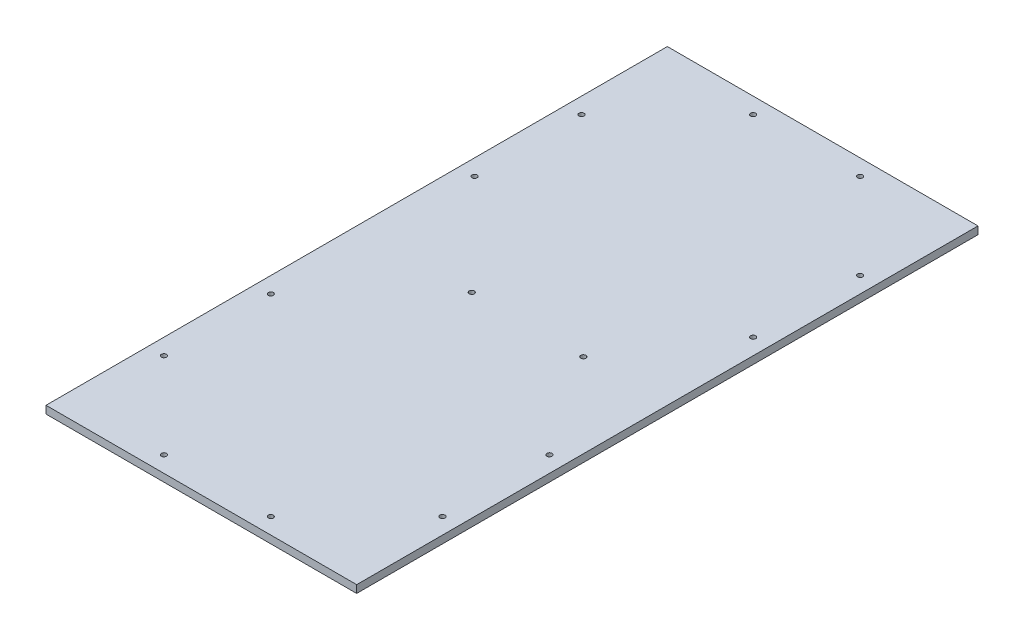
ISO-10303-21;
HEADER;
FILE_DESCRIPTION(('STEP AP214'),'2;1');
FILE_NAME('part.step','',(''),(''),'','','');
FILE_SCHEMA(('AUTOMOTIVE_DESIGN { 1 0 10303 214 1 1 1 1 }'));
ENDSEC;
DATA;
#1=APPLICATION_CONTEXT('core data for automotive mechanical design processes');
#2=APPLICATION_PROTOCOL_DEFINITION('international standard','automotive_design',2000,#1);
#3=PRODUCT_CONTEXT('',#1,'mechanical');
#4=PRODUCT('Part','Part','',(#3));
#5=PRODUCT_RELATED_PRODUCT_CATEGORY('part','',(#4));
#6=PRODUCT_DEFINITION_FORMATION('','',#4);
#7=PRODUCT_DEFINITION_CONTEXT('part definition',#1,'design');
#8=PRODUCT_DEFINITION('design','',#6,#7);
#9=PRODUCT_DEFINITION_SHAPE('','',#8);
#10=(LENGTH_UNIT() NAMED_UNIT(*) SI_UNIT(.MILLI.,.METRE.));
#11=(NAMED_UNIT(*) PLANE_ANGLE_UNIT() SI_UNIT($,.RADIAN.));
#12=(NAMED_UNIT(*) SI_UNIT($,.STERADIAN.) SOLID_ANGLE_UNIT());
#13=UNCERTAINTY_MEASURE_WITH_UNIT(LENGTH_MEASURE(1.E-05),#10,'distance_accuracy_value','');
#14=(GEOMETRIC_REPRESENTATION_CONTEXT(3) GLOBAL_UNCERTAINTY_ASSIGNED_CONTEXT((#13)) GLOBAL_UNIT_ASSIGNED_CONTEXT((#10,
#11,#12)) REPRESENTATION_CONTEXT('',''));
#15=CARTESIAN_POINT('',(0.,0.,0.));
#16=DIRECTION('',(0.,0.,1.));
#17=DIRECTION('',(1.,0.,0.));
#18=AXIS2_PLACEMENT_3D('',#15,#16,#17);
#19=CARTESIAN_POINT('',(0.,15.,0.));
#20=DIRECTION('',(1.,0.,0.));
#21=DIRECTION('',(0.,0.,-1.));
#22=AXIS2_PLACEMENT_3D('',#19,#20,#21);
#23=PLANE('',#22);
#24=DIRECTION('',(0.,0.,1.));
#25=VECTOR('',#24,1.);
#26=CARTESIAN_POINT('',(0.,0.,0.));
#27=LINE('',#26,#25);
#28=CARTESIAN_POINT('',(0.,0.,-1220.));
#29=VERTEX_POINT('',#28);
#30=CARTESIAN_POINT('',(0.,0.,0.));
#31=VERTEX_POINT('',#30);
#32=EDGE_CURVE('E98',#29,#31,#27,.T.);
#33=ORIENTED_EDGE('',*,*,#32,.T.);
#34=DIRECTION('',(0.,-1.,0.));
#35=VECTOR('',#34,1.);
#36=CARTESIAN_POINT('',(0.,15.,0.));
#37=LINE('',#36,#35);
#38=CARTESIAN_POINT('',(0.,15.,0.));
#39=VERTEX_POINT('',#38);
#40=EDGE_CURVE('E11',#39,#31,#37,.T.);
#41=ORIENTED_EDGE('',*,*,#40,.F.);
#42=DIRECTION('',(0.,0.,1.));
#43=VECTOR('',#42,1.);
#44=CARTESIAN_POINT('',(0.,15.,0.));
#45=LINE('',#44,#43);
#46=CARTESIAN_POINT('',(0.,15.,-1220.));
#47=VERTEX_POINT('',#46);
#48=EDGE_CURVE('E86',#47,#39,#45,.T.);
#49=ORIENTED_EDGE('',*,*,#48,.F.);
#50=DIRECTION('',(0.,-1.,0.));
#51=VECTOR('',#50,1.);
#52=CARTESIAN_POINT('',(0.,15.,-1220.));
#53=LINE('',#52,#51);
#54=EDGE_CURVE('E94',#47,#29,#53,.T.);
#55=ORIENTED_EDGE('',*,*,#54,.T.);
#56=EDGE_LOOP('',(#33,#41,#49,#55));
#57=FACE_BOUND('',#56,.T.);
#58=ADVANCED_FACE('F35',(#57),#23,.F.);
#59=CARTESIAN_POINT('',(0.,15.,0.));
#60=DIRECTION('',(0.,0.,-1.));
#61=DIRECTION('',(-1.,0.,0.));
#62=AXIS2_PLACEMENT_3D('',#59,#60,#61);
#63=PLANE('',#62);
#64=DIRECTION('',(1.,0.,0.));
#65=VECTOR('',#64,1.);
#66=CARTESIAN_POINT('',(0.,0.,0.));
#67=LINE('',#66,#65);
#68=CARTESIAN_POINT('',(610.,0.,0.));
#69=VERTEX_POINT('',#68);
#70=EDGE_CURVE('E90',#31,#69,#67,.T.);
#71=ORIENTED_EDGE('',*,*,#70,.T.);
#72=DIRECTION('',(0.,-1.,0.));
#73=VECTOR('',#72,1.);
#74=CARTESIAN_POINT('',(610.,15.,0.));
#75=LINE('',#74,#73);
#76=CARTESIAN_POINT('',(610.,15.,0.));
#77=VERTEX_POINT('',#76);
#78=EDGE_CURVE('E43',#77,#69,#75,.T.);
#79=ORIENTED_EDGE('',*,*,#78,.F.);
#80=DIRECTION('',(1.,0.,0.));
#81=VECTOR('',#80,1.);
#82=CARTESIAN_POINT('',(0.,15.,0.));
#83=LINE('',#82,#81);
#84=EDGE_CURVE('E81',#39,#77,#83,.T.);
#85=ORIENTED_EDGE('',*,*,#84,.F.);
#86=ORIENTED_EDGE('',*,*,#40,.T.);
#87=EDGE_LOOP('',(#71,#79,#85,#86));
#88=FACE_BOUND('',#87,.T.);
#89=ADVANCED_FACE('F89',(#88),#63,.F.);
#90=CARTESIAN_POINT('',(610.,15.,0.));
#91=DIRECTION('',(-1.,0.,0.));
#92=DIRECTION('',(0.,0.,1.));
#93=AXIS2_PLACEMENT_3D('',#90,#91,#92);
#94=PLANE('',#93);
#95=DIRECTION('',(0.,0.,-1.));
#96=VECTOR('',#95,1.);
#97=CARTESIAN_POINT('',(610.,0.,0.));
#98=LINE('',#97,#96);
#99=CARTESIAN_POINT('',(610.,0.,-1220.));
#100=VERTEX_POINT('',#99);
#101=EDGE_CURVE('E68',#69,#100,#98,.T.);
#102=ORIENTED_EDGE('',*,*,#101,.T.);
#103=DIRECTION('',(0.,-1.,0.));
#104=VECTOR('',#103,1.);
#105=CARTESIAN_POINT('',(610.,15.,-1220.));
#106=LINE('',#105,#104);
#107=CARTESIAN_POINT('',(610.,15.,-1220.));
#108=VERTEX_POINT('',#107);
#109=EDGE_CURVE('E91',#108,#100,#106,.T.);
#110=ORIENTED_EDGE('',*,*,#109,.F.);
#111=DIRECTION('',(0.,0.,-1.));
#112=VECTOR('',#111,1.);
#113=CARTESIAN_POINT('',(610.,15.,0.));
#114=LINE('',#113,#112);
#115=EDGE_CURVE('E84',#77,#108,#114,.T.);
#116=ORIENTED_EDGE('',*,*,#115,.F.);
#117=ORIENTED_EDGE('',*,*,#78,.T.);
#118=EDGE_LOOP('',(#102,#110,#116,#117));
#119=FACE_BOUND('',#118,.T.);
#120=ADVANCED_FACE('F92',(#119),#94,.F.);
#121=CARTESIAN_POINT('',(0.,15.,-1220.));
#122=DIRECTION('',(0.,0.,1.));
#123=DIRECTION('',(1.,0.,0.));
#124=AXIS2_PLACEMENT_3D('',#121,#122,#123);
#125=PLANE('',#124);
#126=DIRECTION('',(-1.,0.,0.));
#127=VECTOR('',#126,1.);
#128=CARTESIAN_POINT('',(0.,0.,-1220.));
#129=LINE('',#128,#127);
#130=EDGE_CURVE('E74',#100,#29,#129,.T.);
#131=ORIENTED_EDGE('',*,*,#130,.T.);
#132=ORIENTED_EDGE('',*,*,#54,.F.);
#133=DIRECTION('',(-1.,0.,0.));
#134=VECTOR('',#133,1.);
#135=CARTESIAN_POINT('',(0.,15.,-1220.));
#136=LINE('',#135,#134);
#137=EDGE_CURVE('E51',#108,#47,#136,.T.);
#138=ORIENTED_EDGE('',*,*,#137,.F.);
#139=ORIENTED_EDGE('',*,*,#109,.T.);
#140=EDGE_LOOP('',(#131,#132,#138,#139));
#141=FACE_BOUND('',#140,.T.);
#142=ADVANCED_FACE('F106',(#141),#125,.F.);
#143=CARTESIAN_POINT('',(0.,15.,0.));
#144=DIRECTION('',(0.,-1.,0.));
#145=DIRECTION('',(0.,0.,-1.));
#146=AXIS2_PLACEMENT_3D('',#143,#144,#145);
#147=PLANE('',#146);
#148=CARTESIAN_POINT('',(200.,15.,-31.5000000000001));
#149=DIRECTION('',(0.,1.,0.));
#150=DIRECTION('',(0.,0.,1.));
#151=AXIS2_PLACEMENT_3D('',#148,#149,#150);
#152=CIRCLE('',#151,4.99999999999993);
#153=CARTESIAN_POINT('',(200.,15.,-26.5000000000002));
#154=VERTEX_POINT('',#153);
#155=EDGE_CURVE('E115',#154,#154,#152,.T.);
#156=ORIENTED_EDGE('',*,*,#155,.F.);
#157=EDGE_LOOP('',(#156));
#158=FACE_BOUND('',#157,.T.);
#159=CARTESIAN_POINT('',(410.,15.,-31.5000000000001));
#160=DIRECTION('',(0.,1.,0.));
#161=DIRECTION('',(0.,0.,1.));
#162=AXIS2_PLACEMENT_3D('',#159,#160,#161);
#163=CIRCLE('',#162,5.00000000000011);
#164=CARTESIAN_POINT('',(410.,15.,-26.5));
#165=VERTEX_POINT('',#164);
#166=EDGE_CURVE('E158',#165,#165,#163,.T.);
#167=ORIENTED_EDGE('',*,*,#166,.F.);
#168=EDGE_LOOP('',(#167));
#169=FACE_BOUND('',#168,.T.);
#170=CARTESIAN_POINT('',(31.5000000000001,15.,-200.));
#171=DIRECTION('',(0.,1.,0.));
#172=DIRECTION('',(0.,0.,1.));
#173=AXIS2_PLACEMENT_3D('',#170,#171,#172);
#174=CIRCLE('',#173,4.99999999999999);
#175=CARTESIAN_POINT('',(31.5000000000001,15.,-195.));
#176=VERTEX_POINT('',#175);
#177=EDGE_CURVE('E152',#176,#176,#174,.T.);
#178=ORIENTED_EDGE('',*,*,#177,.F.);
#179=EDGE_LOOP('',(#178));
#180=FACE_BOUND('',#179,.T.);
#181=CARTESIAN_POINT('',(31.5,15.,-410.));
#182=DIRECTION('',(0.,1.,0.));
#183=DIRECTION('',(0.,0.,1.));
#184=AXIS2_PLACEMENT_3D('',#181,#182,#183);
#185=CIRCLE('',#184,5.00000000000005);
#186=CARTESIAN_POINT('',(31.5,15.,-405.));
#187=VERTEX_POINT('',#186);
#188=EDGE_CURVE('E146',#187,#187,#185,.T.);
#189=ORIENTED_EDGE('',*,*,#188,.F.);
#190=EDGE_LOOP('',(#189));
#191=FACE_BOUND('',#190,.T.);
#192=CARTESIAN_POINT('',(31.5,15.,-810.));
#193=DIRECTION('',(0.,1.,0.));
#194=DIRECTION('',(0.,0.,1.));
#195=AXIS2_PLACEMENT_3D('',#192,#193,#194);
#196=CIRCLE('',#195,5.00000000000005);
#197=CARTESIAN_POINT('',(31.5,15.,-805.));
#198=VERTEX_POINT('',#197);
#199=EDGE_CURVE('E140',#198,#198,#196,.T.);
#200=ORIENTED_EDGE('',*,*,#199,.F.);
#201=EDGE_LOOP('',(#200));
#202=FACE_BOUND('',#201,.T.);
#203=CARTESIAN_POINT('',(31.4999999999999,15.,-1020.));
#204=DIRECTION('',(0.,1.,0.));
#205=DIRECTION('',(0.,0.,1.));
#206=AXIS2_PLACEMENT_3D('',#203,#204,#205);
#207=CIRCLE('',#206,5.00000000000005);
#208=CARTESIAN_POINT('',(31.4999999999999,15.,-1015.));
#209=VERTEX_POINT('',#208);
#210=EDGE_CURVE('E134',#209,#209,#207,.T.);
#211=ORIENTED_EDGE('',*,*,#210,.F.);
#212=EDGE_LOOP('',(#211));
#213=FACE_BOUND('',#212,.T.);
#214=CARTESIAN_POINT('',(200.,15.,-1188.5));
#215=DIRECTION('',(0.,1.,0.));
#216=DIRECTION('',(0.,0.,1.));
#217=AXIS2_PLACEMENT_3D('',#214,#215,#216);
#218=CIRCLE('',#217,4.99999999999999);
#219=CARTESIAN_POINT('',(200.,15.,-1183.5));
#220=VERTEX_POINT('',#219);
#221=EDGE_CURVE('E128',#220,#220,#218,.T.);
#222=ORIENTED_EDGE('',*,*,#221,.F.);
#223=EDGE_LOOP('',(#222));
#224=FACE_BOUND('',#223,.T.);
#225=CARTESIAN_POINT('',(410.,15.,-1188.5));
#226=DIRECTION('',(0.,1.,0.));
#227=DIRECTION('',(0.,0.,1.));
#228=AXIS2_PLACEMENT_3D('',#225,#226,#227);
#229=CIRCLE('',#228,4.99999999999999);
#230=CARTESIAN_POINT('',(410.,15.,-1183.5));
#231=VERTEX_POINT('',#230);
#232=EDGE_CURVE('E121',#231,#231,#229,.T.);
#233=ORIENTED_EDGE('',*,*,#232,.F.);
#234=EDGE_LOOP('',(#233));
#235=FACE_BOUND('',#234,.T.);
#236=CARTESIAN_POINT('',(445.,15.,-610.));
#237=DIRECTION('',(0.,1.,0.));
#238=DIRECTION('',(0.,0.,1.));
#239=AXIS2_PLACEMENT_3D('',#236,#237,#238);
#240=CIRCLE('',#239,5.0000000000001);
#241=CARTESIAN_POINT('',(445.,15.,-605.));
#242=VERTEX_POINT('',#241);
#243=EDGE_CURVE('E170',#242,#242,#240,.T.);
#244=ORIENTED_EDGE('',*,*,#243,.F.);
#245=EDGE_LOOP('',(#244));
#246=FACE_BOUND('',#245,.T.);
#247=CARTESIAN_POINT('',(226.,15.,-610.));
#248=DIRECTION('',(0.,1.,0.));
#249=DIRECTION('',(0.,0.,1.));
#250=AXIS2_PLACEMENT_3D('',#247,#248,#249);
#251=CIRCLE('',#250,4.99999999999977);
#252=CARTESIAN_POINT('',(226.,15.,-605.000000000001));
#253=VERTEX_POINT('',#252);
#254=EDGE_CURVE('E169',#253,#253,#251,.T.);
#255=ORIENTED_EDGE('',*,*,#254,.F.);
#256=EDGE_LOOP('',(#255));
#257=FACE_BOUND('',#256,.T.);
#258=CARTESIAN_POINT('',(578.5,15.,-410.));
#259=DIRECTION('',(0.,1.,0.));
#260=DIRECTION('',(0.,0.,1.));
#261=AXIS2_PLACEMENT_3D('',#258,#259,#260);
#262=CIRCLE('',#261,5.00000000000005);
#263=CARTESIAN_POINT('',(578.5,15.,-405.));
#264=VERTEX_POINT('',#263);
#265=EDGE_CURVE('E176',#264,#264,#262,.T.);
#266=ORIENTED_EDGE('',*,*,#265,.F.);
#267=EDGE_LOOP('',(#266));
#268=FACE_BOUND('',#267,.T.);
#269=CARTESIAN_POINT('',(578.5,15.,-810.));
#270=DIRECTION('',(0.,1.,0.));
#271=DIRECTION('',(0.,0.,1.));
#272=AXIS2_PLACEMENT_3D('',#269,#270,#271);
#273=CIRCLE('',#272,5.00000000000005);
#274=CARTESIAN_POINT('',(578.5,15.,-805.));
#275=VERTEX_POINT('',#274);
#276=EDGE_CURVE('E182',#275,#275,#273,.T.);
#277=ORIENTED_EDGE('',*,*,#276,.F.);
#278=EDGE_LOOP('',(#277));
#279=FACE_BOUND('',#278,.T.);
#280=CARTESIAN_POINT('',(578.5,15.,-1020.));
#281=DIRECTION('',(0.,1.,0.));
#282=DIRECTION('',(0.,0.,1.));
#283=AXIS2_PLACEMENT_3D('',#280,#281,#282);
#284=CIRCLE('',#283,5.00000000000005);
#285=CARTESIAN_POINT('',(578.5,15.,-1015.));
#286=VERTEX_POINT('',#285);
#287=EDGE_CURVE('E122',#286,#286,#284,.T.);
#288=ORIENTED_EDGE('',*,*,#287,.F.);
#289=EDGE_LOOP('',(#288));
#290=FACE_BOUND('',#289,.T.);
#291=CARTESIAN_POINT('',(578.5,15.,-200.));
#292=DIRECTION('',(0.,1.,0.));
#293=DIRECTION('',(0.,0.,1.));
#294=AXIS2_PLACEMENT_3D('',#291,#292,#293);
#295=CIRCLE('',#294,5.00000000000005);
#296=CARTESIAN_POINT('',(578.5,15.,-195.));
#297=VERTEX_POINT('',#296);
#298=EDGE_CURVE('E101',#297,#297,#295,.T.);
#299=ORIENTED_EDGE('',*,*,#298,.F.);
#300=EDGE_LOOP('',(#299));
#301=FACE_BOUND('',#300,.T.);
#302=ORIENTED_EDGE('',*,*,#48,.T.);
#303=ORIENTED_EDGE('',*,*,#84,.T.);
#304=ORIENTED_EDGE('',*,*,#115,.T.);
#305=ORIENTED_EDGE('',*,*,#137,.T.);
#306=EDGE_LOOP('',(#302,#303,#304,#305));
#307=FACE_BOUND('',#306,.T.);
#308=ADVANCED_FACE('F82',(#158,#169,#180,#191,#202,#213,#224,#235,#246,#257,#268,#279,#290,#301,
#307),#147,.F.);
#309=CARTESIAN_POINT('',(0.,0.,0.));
#310=DIRECTION('',(0.,-1.,0.));
#311=DIRECTION('',(0.,0.,-1.));
#312=AXIS2_PLACEMENT_3D('',#309,#310,#311);
#313=PLANE('',#312);
#314=CARTESIAN_POINT('',(200.,0.,-31.5000000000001));
#315=DIRECTION('',(0.,-1.,0.));
#316=DIRECTION('',(0.,0.,-1.));
#317=AXIS2_PLACEMENT_3D('',#314,#315,#316);
#318=CIRCLE('',#317,4.99999999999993);
#319=CARTESIAN_POINT('',(200.,0.,-26.5000000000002));
#320=VERTEX_POINT('',#319);
#321=EDGE_CURVE('E161',#320,#320,#318,.F.);
#322=ORIENTED_EDGE('',*,*,#321,.T.);
#323=EDGE_LOOP('',(#322));
#324=FACE_BOUND('',#323,.T.);
#325=CARTESIAN_POINT('',(410.,0.,-31.5000000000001));
#326=DIRECTION('',(0.,-1.,0.));
#327=DIRECTION('',(0.,0.,-1.));
#328=AXIS2_PLACEMENT_3D('',#325,#326,#327);
#329=CIRCLE('',#328,5.00000000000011);
#330=CARTESIAN_POINT('',(410.,0.,-26.5));
#331=VERTEX_POINT('',#330);
#332=EDGE_CURVE('E155',#331,#331,#329,.F.);
#333=ORIENTED_EDGE('',*,*,#332,.T.);
#334=EDGE_LOOP('',(#333));
#335=FACE_BOUND('',#334,.T.);
#336=CARTESIAN_POINT('',(31.5000000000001,0.,-200.));
#337=DIRECTION('',(0.,-1.,0.));
#338=DIRECTION('',(0.,0.,-1.));
#339=AXIS2_PLACEMENT_3D('',#336,#337,#338);
#340=CIRCLE('',#339,4.99999999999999);
#341=CARTESIAN_POINT('',(31.5000000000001,0.,-195.));
#342=VERTEX_POINT('',#341);
#343=EDGE_CURVE('E149',#342,#342,#340,.F.);
#344=ORIENTED_EDGE('',*,*,#343,.T.);
#345=EDGE_LOOP('',(#344));
#346=FACE_BOUND('',#345,.T.);
#347=CARTESIAN_POINT('',(31.5,0.,-410.));
#348=DIRECTION('',(0.,-1.,0.));
#349=DIRECTION('',(0.,0.,-1.));
#350=AXIS2_PLACEMENT_3D('',#347,#348,#349);
#351=CIRCLE('',#350,5.00000000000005);
#352=CARTESIAN_POINT('',(31.5,0.,-405.));
#353=VERTEX_POINT('',#352);
#354=EDGE_CURVE('E143',#353,#353,#351,.F.);
#355=ORIENTED_EDGE('',*,*,#354,.T.);
#356=EDGE_LOOP('',(#355));
#357=FACE_BOUND('',#356,.T.);
#358=CARTESIAN_POINT('',(31.5,0.,-810.));
#359=DIRECTION('',(0.,-1.,0.));
#360=DIRECTION('',(0.,0.,-1.));
#361=AXIS2_PLACEMENT_3D('',#358,#359,#360);
#362=CIRCLE('',#361,5.00000000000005);
#363=CARTESIAN_POINT('',(31.5,0.,-805.));
#364=VERTEX_POINT('',#363);
#365=EDGE_CURVE('E137',#364,#364,#362,.F.);
#366=ORIENTED_EDGE('',*,*,#365,.T.);
#367=EDGE_LOOP('',(#366));
#368=FACE_BOUND('',#367,.T.);
#369=CARTESIAN_POINT('',(31.4999999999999,0.,-1020.));
#370=DIRECTION('',(0.,-1.,0.));
#371=DIRECTION('',(0.,0.,-1.));
#372=AXIS2_PLACEMENT_3D('',#369,#370,#371);
#373=CIRCLE('',#372,5.00000000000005);
#374=CARTESIAN_POINT('',(31.4999999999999,0.,-1015.));
#375=VERTEX_POINT('',#374);
#376=EDGE_CURVE('E131',#375,#375,#373,.F.);
#377=ORIENTED_EDGE('',*,*,#376,.T.);
#378=EDGE_LOOP('',(#377));
#379=FACE_BOUND('',#378,.T.);
#380=CARTESIAN_POINT('',(200.,0.,-1188.5));
#381=DIRECTION('',(0.,-1.,0.));
#382=DIRECTION('',(0.,0.,-1.));
#383=AXIS2_PLACEMENT_3D('',#380,#381,#382);
#384=CIRCLE('',#383,4.99999999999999);
#385=CARTESIAN_POINT('',(200.,0.,-1183.5));
#386=VERTEX_POINT('',#385);
#387=EDGE_CURVE('E125',#386,#386,#384,.F.);
#388=ORIENTED_EDGE('',*,*,#387,.T.);
#389=EDGE_LOOP('',(#388));
#390=FACE_BOUND('',#389,.T.);
#391=CARTESIAN_POINT('',(410.,0.,-1188.5));
#392=DIRECTION('',(0.,-1.,0.));
#393=DIRECTION('',(0.,0.,-1.));
#394=AXIS2_PLACEMENT_3D('',#391,#392,#393);
#395=CIRCLE('',#394,4.99999999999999);
#396=CARTESIAN_POINT('',(410.,0.,-1183.5));
#397=VERTEX_POINT('',#396);
#398=EDGE_CURVE('E118',#397,#397,#395,.F.);
#399=ORIENTED_EDGE('',*,*,#398,.T.);
#400=EDGE_LOOP('',(#399));
#401=FACE_BOUND('',#400,.T.);
#402=CARTESIAN_POINT('',(445.,0.,-610.));
#403=DIRECTION('',(0.,-1.,0.));
#404=DIRECTION('',(0.,0.,-1.));
#405=AXIS2_PLACEMENT_3D('',#402,#403,#404);
#406=CIRCLE('',#405,5.0000000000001);
#407=CARTESIAN_POINT('',(445.,0.,-605.));
#408=VERTEX_POINT('',#407);
#409=EDGE_CURVE('E190',#408,#408,#406,.F.);
#410=ORIENTED_EDGE('',*,*,#409,.T.);
#411=EDGE_LOOP('',(#410));
#412=FACE_BOUND('',#411,.T.);
#413=CARTESIAN_POINT('',(226.,0.,-610.));
#414=DIRECTION('',(0.,-1.,0.));
#415=DIRECTION('',(0.,0.,-1.));
#416=AXIS2_PLACEMENT_3D('',#413,#414,#415);
#417=CIRCLE('',#416,4.99999999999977);
#418=CARTESIAN_POINT('',(226.,0.,-605.000000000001));
#419=VERTEX_POINT('',#418);
#420=EDGE_CURVE('E166',#419,#419,#417,.F.);
#421=ORIENTED_EDGE('',*,*,#420,.T.);
#422=EDGE_LOOP('',(#421));
#423=FACE_BOUND('',#422,.T.);
#424=CARTESIAN_POINT('',(578.5,0.,-410.));
#425=DIRECTION('',(0.,-1.,0.));
#426=DIRECTION('',(0.,0.,-1.));
#427=AXIS2_PLACEMENT_3D('',#424,#425,#426);
#428=CIRCLE('',#427,5.00000000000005);
#429=CARTESIAN_POINT('',(578.5,0.,-405.));
#430=VERTEX_POINT('',#429);
#431=EDGE_CURVE('E173',#430,#430,#428,.F.);
#432=ORIENTED_EDGE('',*,*,#431,.T.);
#433=EDGE_LOOP('',(#432));
#434=FACE_BOUND('',#433,.T.);
#435=CARTESIAN_POINT('',(578.5,0.,-810.));
#436=DIRECTION('',(0.,-1.,0.));
#437=DIRECTION('',(0.,0.,-1.));
#438=AXIS2_PLACEMENT_3D('',#435,#436,#437);
#439=CIRCLE('',#438,5.00000000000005);
#440=CARTESIAN_POINT('',(578.5,0.,-805.));
#441=VERTEX_POINT('',#440);
#442=EDGE_CURVE('E179',#441,#441,#439,.F.);
#443=ORIENTED_EDGE('',*,*,#442,.T.);
#444=EDGE_LOOP('',(#443));
#445=FACE_BOUND('',#444,.T.);
#446=CARTESIAN_POINT('',(578.5,0.,-1020.));
#447=DIRECTION('',(0.,-1.,0.));
#448=DIRECTION('',(0.,0.,-1.));
#449=AXIS2_PLACEMENT_3D('',#446,#447,#448);
#450=CIRCLE('',#449,5.00000000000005);
#451=CARTESIAN_POINT('',(578.5,0.,-1015.));
#452=VERTEX_POINT('',#451);
#453=EDGE_CURVE('E185',#452,#452,#450,.F.);
#454=ORIENTED_EDGE('',*,*,#453,.T.);
#455=EDGE_LOOP('',(#454));
#456=FACE_BOUND('',#455,.T.);
#457=CARTESIAN_POINT('',(578.5,0.,-200.));
#458=DIRECTION('',(0.,-1.,0.));
#459=DIRECTION('',(0.,0.,-1.));
#460=AXIS2_PLACEMENT_3D('',#457,#458,#459);
#461=CIRCLE('',#460,5.00000000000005);
#462=CARTESIAN_POINT('',(578.5,0.,-195.));
#463=VERTEX_POINT('',#462);
#464=EDGE_CURVE('E112',#463,#463,#461,.F.);
#465=ORIENTED_EDGE('',*,*,#464,.T.);
#466=EDGE_LOOP('',(#465));
#467=FACE_BOUND('',#466,.T.);
#468=ORIENTED_EDGE('',*,*,#32,.F.);
#469=ORIENTED_EDGE('',*,*,#130,.F.);
#470=ORIENTED_EDGE('',*,*,#101,.F.);
#471=ORIENTED_EDGE('',*,*,#70,.F.);
#472=EDGE_LOOP('',(#468,#469,#470,#471));
#473=FACE_BOUND('',#472,.T.);
#474=ADVANCED_FACE('F109',(#324,#335,#346,#357,#368,#379,#390,#401,#412,#423,#434,#445,#456,
#467,#473),#313,.T.);
#475=CARTESIAN_POINT('',(578.5,-0.000999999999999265,-200.));
#476=DIRECTION('',(0.,1.,0.));
#477=DIRECTION('',(0.,0.,1.));
#478=AXIS2_PLACEMENT_3D('',#475,#476,#477);
#479=CYLINDRICAL_SURFACE('',#478,5.00000000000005);
#480=CARTESIAN_POINT('',(578.5,0.,-195.));
#481=CARTESIAN_POINT('',(578.5,0.15625,-195.));
#482=CARTESIAN_POINT('',(578.5,0.3125,-195.));
#483=CARTESIAN_POINT('',(578.5,0.625,-195.));
#484=CARTESIAN_POINT('',(578.5,0.78125,-195.));
#485=CARTESIAN_POINT('',(578.5,1.09375,-195.));
#486=CARTESIAN_POINT('',(578.5,1.25,-195.));
#487=CARTESIAN_POINT('',(578.5,1.5625,-195.));
#488=CARTESIAN_POINT('',(578.5,1.71875,-195.));
#489=CARTESIAN_POINT('',(578.5,2.03125,-195.));
#490=CARTESIAN_POINT('',(578.5,2.1875,-195.));
#491=CARTESIAN_POINT('',(578.5,2.5,-195.));
#492=CARTESIAN_POINT('',(578.5,2.65625,-195.));
#493=CARTESIAN_POINT('',(578.5,2.96875,-195.));
#494=CARTESIAN_POINT('',(578.5,3.125,-195.));
#495=CARTESIAN_POINT('',(578.5,3.4375,-195.));
#496=CARTESIAN_POINT('',(578.5,3.59375,-195.));
#497=CARTESIAN_POINT('',(578.5,3.90625,-195.));
#498=CARTESIAN_POINT('',(578.5,4.0625,-195.));
#499=CARTESIAN_POINT('',(578.5,4.375,-195.));
#500=CARTESIAN_POINT('',(578.5,4.53125,-195.));
#501=CARTESIAN_POINT('',(578.5,4.84375,-195.));
#502=CARTESIAN_POINT('',(578.5,5.,-195.));
#503=CARTESIAN_POINT('',(578.5,5.3125,-195.));
#504=CARTESIAN_POINT('',(578.5,5.46875,-195.));
#505=CARTESIAN_POINT('',(578.5,5.78125,-195.));
#506=CARTESIAN_POINT('',(578.5,5.9375,-195.));
#507=CARTESIAN_POINT('',(578.5,6.25,-195.));
#508=CARTESIAN_POINT('',(578.5,6.40625,-195.));
#509=CARTESIAN_POINT('',(578.5,6.71875,-195.));
#510=CARTESIAN_POINT('',(578.5,6.875,-195.));
#511=CARTESIAN_POINT('',(578.5,7.1875,-195.));
#512=CARTESIAN_POINT('',(578.5,7.34375,-195.));
#513=CARTESIAN_POINT('',(578.5,7.65625,-195.));
#514=CARTESIAN_POINT('',(578.5,7.8125,-195.));
#515=CARTESIAN_POINT('',(578.5,8.125,-195.));
#516=CARTESIAN_POINT('',(578.5,8.28125,-195.));
#517=CARTESIAN_POINT('',(578.5,8.59375,-195.));
#518=CARTESIAN_POINT('',(578.5,8.75,-195.));
#519=CARTESIAN_POINT('',(578.5,9.0625,-195.));
#520=CARTESIAN_POINT('',(578.5,9.21875,-195.));
#521=CARTESIAN_POINT('',(578.5,9.53125,-195.));
#522=CARTESIAN_POINT('',(578.5,9.6875,-195.));
#523=CARTESIAN_POINT('',(578.5,10.,-195.));
#524=CARTESIAN_POINT('',(578.5,10.15625,-195.));
#525=CARTESIAN_POINT('',(578.5,10.46875,-195.));
#526=CARTESIAN_POINT('',(578.5,10.625,-195.));
#527=CARTESIAN_POINT('',(578.5,10.9375,-195.));
#528=CARTESIAN_POINT('',(578.5,11.09375,-195.));
#529=CARTESIAN_POINT('',(578.5,11.40625,-195.));
#530=CARTESIAN_POINT('',(578.5,11.5625,-195.));
#531=CARTESIAN_POINT('',(578.5,11.875,-195.));
#532=CARTESIAN_POINT('',(578.5,12.03125,-195.));
#533=CARTESIAN_POINT('',(578.5,12.34375,-195.));
#534=CARTESIAN_POINT('',(578.5,12.5,-195.));
#535=CARTESIAN_POINT('',(578.5,12.8125,-195.));
#536=CARTESIAN_POINT('',(578.5,12.96875,-195.));
#537=CARTESIAN_POINT('',(578.5,13.28125,-195.));
#538=CARTESIAN_POINT('',(578.5,13.4375,-195.));
#539=CARTESIAN_POINT('',(578.5,13.75,-195.));
#540=CARTESIAN_POINT('',(578.5,13.90625,-195.));
#541=CARTESIAN_POINT('',(578.5,14.21875,-195.));
#542=CARTESIAN_POINT('',(578.5,14.375,-195.));
#543=CARTESIAN_POINT('',(578.5,14.6875,-195.));
#544=CARTESIAN_POINT('',(578.5,14.84375,-195.));
#545=CARTESIAN_POINT('',(578.5,15.,-195.));
#546=B_SPLINE_CURVE_WITH_KNOTS('',3,(#480,#481,#482,#483,#484,#485,#486,#487,#488,#489,#490,
#491,#492,#493,#494,#495,#496,#497,#498,#499,#500,#501,#502,#503,#504,#505,#506,#507,#508,#509,
#510,#511,#512,#513,#514,#515,#516,#517,#518,#519,#520,#521,#522,#523,#524,#525,#526,#527,#528,
#529,#530,#531,#532,#533,#534,#535,#536,#537,#538,#539,#540,#541,#542,#543,#544,#545),
.UNSPECIFIED.,.F.,.F.,(4,2,2,2,2,2,2,2,2,2,2,2,2,2,2,2,2,2,2,2,2,2,2,2,2,2,2,2,2,2,2,2,4),(0.,
0.46875,0.9375,1.40625,1.875,2.34375,2.8125,3.28125,3.75,4.21875,4.6875,5.15625,5.625,6.09375,
6.5625,7.03125,7.5,7.96875,8.4375,8.90625,9.375,9.84375,10.3125,10.78125,11.25,11.71875,12.1875,
12.65625,13.125,13.59375,14.0625,14.53125,15.),.UNSPECIFIED.);
#547=EDGE_CURVE('BSEAM212',#463,#297,#546,.T.);
#548=ORIENTED_EDGE('',*,*,#464,.F.);
#549=ORIENTED_EDGE('',*,*,#298,.T.);
#550=ORIENTED_EDGE('',*,*,#547,.T.);
#551=ORIENTED_EDGE('',*,*,#547,.F.);
#552=EDGE_LOOP('',(#548,#550,#549,#551));
#553=FACE_BOUND('',#552,.T.);
#554=ADVANCED_FACE('F212',(#553),#479,.F.);
#555=CARTESIAN_POINT('',(578.5,-0.000999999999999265,-1020.));
#556=DIRECTION('',(0.,1.,0.));
#557=DIRECTION('',(0.,0.,1.));
#558=AXIS2_PLACEMENT_3D('',#555,#556,#557);
#559=CYLINDRICAL_SURFACE('',#558,5.00000000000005);
#560=CARTESIAN_POINT('',(578.5,0.,-1015.));
#561=CARTESIAN_POINT('',(578.5,0.15625,-1015.));
#562=CARTESIAN_POINT('',(578.5,0.3125,-1015.));
#563=CARTESIAN_POINT('',(578.5,0.625,-1015.));
#564=CARTESIAN_POINT('',(578.5,0.78125,-1015.));
#565=CARTESIAN_POINT('',(578.5,1.09375,-1015.));
#566=CARTESIAN_POINT('',(578.5,1.25,-1015.));
#567=CARTESIAN_POINT('',(578.5,1.5625,-1015.));
#568=CARTESIAN_POINT('',(578.5,1.71875,-1015.));
#569=CARTESIAN_POINT('',(578.5,2.03125,-1015.));
#570=CARTESIAN_POINT('',(578.5,2.1875,-1015.));
#571=CARTESIAN_POINT('',(578.5,2.5,-1015.));
#572=CARTESIAN_POINT('',(578.5,2.65625,-1015.));
#573=CARTESIAN_POINT('',(578.5,2.96875,-1015.));
#574=CARTESIAN_POINT('',(578.5,3.125,-1015.));
#575=CARTESIAN_POINT('',(578.5,3.4375,-1015.));
#576=CARTESIAN_POINT('',(578.5,3.59375,-1015.));
#577=CARTESIAN_POINT('',(578.5,3.90625,-1015.));
#578=CARTESIAN_POINT('',(578.5,4.0625,-1015.));
#579=CARTESIAN_POINT('',(578.5,4.375,-1015.));
#580=CARTESIAN_POINT('',(578.5,4.53125,-1015.));
#581=CARTESIAN_POINT('',(578.5,4.84375,-1015.));
#582=CARTESIAN_POINT('',(578.5,5.,-1015.));
#583=CARTESIAN_POINT('',(578.5,5.3125,-1015.));
#584=CARTESIAN_POINT('',(578.5,5.46875,-1015.));
#585=CARTESIAN_POINT('',(578.5,5.78125,-1015.));
#586=CARTESIAN_POINT('',(578.5,5.9375,-1015.));
#587=CARTESIAN_POINT('',(578.5,6.25,-1015.));
#588=CARTESIAN_POINT('',(578.5,6.40625,-1015.));
#589=CARTESIAN_POINT('',(578.5,6.71875,-1015.));
#590=CARTESIAN_POINT('',(578.5,6.875,-1015.));
#591=CARTESIAN_POINT('',(578.5,7.1875,-1015.));
#592=CARTESIAN_POINT('',(578.5,7.34375,-1015.));
#593=CARTESIAN_POINT('',(578.5,7.65625,-1015.));
#594=CARTESIAN_POINT('',(578.5,7.8125,-1015.));
#595=CARTESIAN_POINT('',(578.5,8.125,-1015.));
#596=CARTESIAN_POINT('',(578.5,8.28125,-1015.));
#597=CARTESIAN_POINT('',(578.5,8.59375,-1015.));
#598=CARTESIAN_POINT('',(578.5,8.75,-1015.));
#599=CARTESIAN_POINT('',(578.5,9.0625,-1015.));
#600=CARTESIAN_POINT('',(578.5,9.21875,-1015.));
#601=CARTESIAN_POINT('',(578.5,9.53125,-1015.));
#602=CARTESIAN_POINT('',(578.5,9.6875,-1015.));
#603=CARTESIAN_POINT('',(578.5,10.,-1015.));
#604=CARTESIAN_POINT('',(578.5,10.15625,-1015.));
#605=CARTESIAN_POINT('',(578.5,10.46875,-1015.));
#606=CARTESIAN_POINT('',(578.5,10.625,-1015.));
#607=CARTESIAN_POINT('',(578.5,10.9375,-1015.));
#608=CARTESIAN_POINT('',(578.5,11.09375,-1015.));
#609=CARTESIAN_POINT('',(578.5,11.40625,-1015.));
#610=CARTESIAN_POINT('',(578.5,11.5625,-1015.));
#611=CARTESIAN_POINT('',(578.5,11.875,-1015.));
#612=CARTESIAN_POINT('',(578.5,12.03125,-1015.));
#613=CARTESIAN_POINT('',(578.5,12.34375,-1015.));
#614=CARTESIAN_POINT('',(578.5,12.5,-1015.));
#615=CARTESIAN_POINT('',(578.5,12.8125,-1015.));
#616=CARTESIAN_POINT('',(578.5,12.96875,-1015.));
#617=CARTESIAN_POINT('',(578.5,13.28125,-1015.));
#618=CARTESIAN_POINT('',(578.5,13.4375,-1015.));
#619=CARTESIAN_POINT('',(578.5,13.75,-1015.));
#620=CARTESIAN_POINT('',(578.5,13.90625,-1015.));
#621=CARTESIAN_POINT('',(578.5,14.21875,-1015.));
#622=CARTESIAN_POINT('',(578.5,14.375,-1015.));
#623=CARTESIAN_POINT('',(578.5,14.6875,-1015.));
#624=CARTESIAN_POINT('',(578.5,14.84375,-1015.));
#625=CARTESIAN_POINT('',(578.5,15.,-1015.));
#626=B_SPLINE_CURVE_WITH_KNOTS('',3,(#560,#561,#562,#563,#564,#565,#566,#567,#568,#569,#570,
#571,#572,#573,#574,#575,#576,#577,#578,#579,#580,#581,#582,#583,#584,#585,#586,#587,#588,#589,
#590,#591,#592,#593,#594,#595,#596,#597,#598,#599,#600,#601,#602,#603,#604,#605,#606,#607,#608,
#609,#610,#611,#612,#613,#614,#615,#616,#617,#618,#619,#620,#621,#622,#623,#624,#625),
.UNSPECIFIED.,.F.,.F.,(4,2,2,2,2,2,2,2,2,2,2,2,2,2,2,2,2,2,2,2,2,2,2,2,2,2,2,2,2,2,2,2,4),(0.,
0.46875,0.9375,1.40625,1.875,2.34375,2.8125,3.28125,3.75,4.21875,4.6875,5.15625,5.625,6.09375,
6.5625,7.03125,7.5,7.96875,8.4375,8.90625,9.375,9.84375,10.3125,10.78125,11.25,11.71875,12.1875,
12.65625,13.125,13.59375,14.0625,14.53125,15.),.UNSPECIFIED.);
#627=EDGE_CURVE('BSEAM214',#452,#286,#626,.T.);
#628=ORIENTED_EDGE('',*,*,#453,.F.);
#629=ORIENTED_EDGE('',*,*,#287,.T.);
#630=ORIENTED_EDGE('',*,*,#627,.T.);
#631=ORIENTED_EDGE('',*,*,#627,.F.);
#632=EDGE_LOOP('',(#628,#630,#629,#631));
#633=FACE_BOUND('',#632,.T.);
#634=ADVANCED_FACE('F214',(#633),#559,.F.);
#635=CARTESIAN_POINT('',(578.5,-0.000999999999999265,-810.));
#636=DIRECTION('',(0.,1.,0.));
#637=DIRECTION('',(0.,0.,1.));
#638=AXIS2_PLACEMENT_3D('',#635,#636,#637);
#639=CYLINDRICAL_SURFACE('',#638,5.00000000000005);
#640=CARTESIAN_POINT('',(578.5,0.,-805.));
#641=CARTESIAN_POINT('',(578.5,0.15625,-805.));
#642=CARTESIAN_POINT('',(578.5,0.3125,-805.));
#643=CARTESIAN_POINT('',(578.5,0.625,-805.));
#644=CARTESIAN_POINT('',(578.5,0.78125,-805.));
#645=CARTESIAN_POINT('',(578.5,1.09375,-805.));
#646=CARTESIAN_POINT('',(578.5,1.25,-805.));
#647=CARTESIAN_POINT('',(578.5,1.5625,-805.));
#648=CARTESIAN_POINT('',(578.5,1.71875,-805.));
#649=CARTESIAN_POINT('',(578.5,2.03125,-805.));
#650=CARTESIAN_POINT('',(578.5,2.1875,-805.));
#651=CARTESIAN_POINT('',(578.5,2.5,-805.));
#652=CARTESIAN_POINT('',(578.5,2.65625,-805.));
#653=CARTESIAN_POINT('',(578.5,2.96875,-805.));
#654=CARTESIAN_POINT('',(578.5,3.125,-805.));
#655=CARTESIAN_POINT('',(578.5,3.4375,-805.));
#656=CARTESIAN_POINT('',(578.5,3.59375,-805.));
#657=CARTESIAN_POINT('',(578.5,3.90625,-805.));
#658=CARTESIAN_POINT('',(578.5,4.0625,-805.));
#659=CARTESIAN_POINT('',(578.5,4.375,-805.));
#660=CARTESIAN_POINT('',(578.5,4.53125,-805.));
#661=CARTESIAN_POINT('',(578.5,4.84375,-805.));
#662=CARTESIAN_POINT('',(578.5,5.,-805.));
#663=CARTESIAN_POINT('',(578.5,5.3125,-805.));
#664=CARTESIAN_POINT('',(578.5,5.46875,-805.));
#665=CARTESIAN_POINT('',(578.5,5.78125,-805.));
#666=CARTESIAN_POINT('',(578.5,5.9375,-805.));
#667=CARTESIAN_POINT('',(578.5,6.25,-805.));
#668=CARTESIAN_POINT('',(578.5,6.40625,-805.));
#669=CARTESIAN_POINT('',(578.5,6.71875,-805.));
#670=CARTESIAN_POINT('',(578.5,6.875,-805.));
#671=CARTESIAN_POINT('',(578.5,7.1875,-805.));
#672=CARTESIAN_POINT('',(578.5,7.34375,-805.));
#673=CARTESIAN_POINT('',(578.5,7.65625,-805.));
#674=CARTESIAN_POINT('',(578.5,7.8125,-805.));
#675=CARTESIAN_POINT('',(578.5,8.125,-805.));
#676=CARTESIAN_POINT('',(578.5,8.28125,-805.));
#677=CARTESIAN_POINT('',(578.5,8.59375,-805.));
#678=CARTESIAN_POINT('',(578.5,8.75,-805.));
#679=CARTESIAN_POINT('',(578.5,9.0625,-805.));
#680=CARTESIAN_POINT('',(578.5,9.21875,-805.));
#681=CARTESIAN_POINT('',(578.5,9.53125,-805.));
#682=CARTESIAN_POINT('',(578.5,9.6875,-805.));
#683=CARTESIAN_POINT('',(578.5,10.,-805.));
#684=CARTESIAN_POINT('',(578.5,10.15625,-805.));
#685=CARTESIAN_POINT('',(578.5,10.46875,-805.));
#686=CARTESIAN_POINT('',(578.5,10.625,-805.));
#687=CARTESIAN_POINT('',(578.5,10.9375,-805.));
#688=CARTESIAN_POINT('',(578.5,11.09375,-805.));
#689=CARTESIAN_POINT('',(578.5,11.40625,-805.));
#690=CARTESIAN_POINT('',(578.5,11.5625,-805.));
#691=CARTESIAN_POINT('',(578.5,11.875,-805.));
#692=CARTESIAN_POINT('',(578.5,12.03125,-805.));
#693=CARTESIAN_POINT('',(578.5,12.34375,-805.));
#694=CARTESIAN_POINT('',(578.5,12.5,-805.));
#695=CARTESIAN_POINT('',(578.5,12.8125,-805.));
#696=CARTESIAN_POINT('',(578.5,12.96875,-805.));
#697=CARTESIAN_POINT('',(578.5,13.28125,-805.));
#698=CARTESIAN_POINT('',(578.5,13.4375,-805.));
#699=CARTESIAN_POINT('',(578.5,13.75,-805.));
#700=CARTESIAN_POINT('',(578.5,13.90625,-805.));
#701=CARTESIAN_POINT('',(578.5,14.21875,-805.));
#702=CARTESIAN_POINT('',(578.5,14.375,-805.));
#703=CARTESIAN_POINT('',(578.5,14.6875,-805.));
#704=CARTESIAN_POINT('',(578.5,14.84375,-805.));
#705=CARTESIAN_POINT('',(578.5,15.,-805.));
#706=B_SPLINE_CURVE_WITH_KNOTS('',3,(#640,#641,#642,#643,#644,#645,#646,#647,#648,#649,#650,
#651,#652,#653,#654,#655,#656,#657,#658,#659,#660,#661,#662,#663,#664,#665,#666,#667,#668,#669,
#670,#671,#672,#673,#674,#675,#676,#677,#678,#679,#680,#681,#682,#683,#684,#685,#686,#687,#688,
#689,#690,#691,#692,#693,#694,#695,#696,#697,#698,#699,#700,#701,#702,#703,#704,#705),
.UNSPECIFIED.,.F.,.F.,(4,2,2,2,2,2,2,2,2,2,2,2,2,2,2,2,2,2,2,2,2,2,2,2,2,2,2,2,2,2,2,2,4),(0.,
0.46875,0.9375,1.40625,1.875,2.34375,2.8125,3.28125,3.75,4.21875,4.6875,5.15625,5.625,6.09375,
6.5625,7.03125,7.5,7.96875,8.4375,8.90625,9.375,9.84375,10.3125,10.78125,11.25,11.71875,12.1875,
12.65625,13.125,13.59375,14.0625,14.53125,15.),.UNSPECIFIED.);
#707=EDGE_CURVE('BSEAM221',#441,#275,#706,.T.);
#708=ORIENTED_EDGE('',*,*,#442,.F.);
#709=ORIENTED_EDGE('',*,*,#276,.T.);
#710=ORIENTED_EDGE('',*,*,#707,.T.);
#711=ORIENTED_EDGE('',*,*,#707,.F.);
#712=EDGE_LOOP('',(#708,#710,#709,#711));
#713=FACE_BOUND('',#712,.T.);
#714=ADVANCED_FACE('F221',(#713),#639,.F.);
#715=CARTESIAN_POINT('',(578.5,-0.000999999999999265,-410.));
#716=DIRECTION('',(0.,1.,0.));
#717=DIRECTION('',(0.,0.,1.));
#718=AXIS2_PLACEMENT_3D('',#715,#716,#717);
#719=CYLINDRICAL_SURFACE('',#718,5.00000000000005);
#720=CARTESIAN_POINT('',(578.5,0.,-405.));
#721=CARTESIAN_POINT('',(578.5,0.15625,-405.));
#722=CARTESIAN_POINT('',(578.5,0.3125,-405.));
#723=CARTESIAN_POINT('',(578.5,0.625,-405.));
#724=CARTESIAN_POINT('',(578.5,0.78125,-405.));
#725=CARTESIAN_POINT('',(578.5,1.09375,-405.));
#726=CARTESIAN_POINT('',(578.5,1.25,-405.));
#727=CARTESIAN_POINT('',(578.5,1.5625,-405.));
#728=CARTESIAN_POINT('',(578.5,1.71875,-405.));
#729=CARTESIAN_POINT('',(578.5,2.03125,-405.));
#730=CARTESIAN_POINT('',(578.5,2.1875,-405.));
#731=CARTESIAN_POINT('',(578.5,2.5,-405.));
#732=CARTESIAN_POINT('',(578.5,2.65625,-405.));
#733=CARTESIAN_POINT('',(578.5,2.96875,-405.));
#734=CARTESIAN_POINT('',(578.5,3.125,-405.));
#735=CARTESIAN_POINT('',(578.5,3.4375,-405.));
#736=CARTESIAN_POINT('',(578.5,3.59375,-405.));
#737=CARTESIAN_POINT('',(578.5,3.90625,-405.));
#738=CARTESIAN_POINT('',(578.5,4.0625,-405.));
#739=CARTESIAN_POINT('',(578.5,4.375,-405.));
#740=CARTESIAN_POINT('',(578.5,4.53125,-405.));
#741=CARTESIAN_POINT('',(578.5,4.84375,-405.));
#742=CARTESIAN_POINT('',(578.5,5.,-405.));
#743=CARTESIAN_POINT('',(578.5,5.3125,-405.));
#744=CARTESIAN_POINT('',(578.5,5.46875,-405.));
#745=CARTESIAN_POINT('',(578.5,5.78125,-405.));
#746=CARTESIAN_POINT('',(578.5,5.9375,-405.));
#747=CARTESIAN_POINT('',(578.5,6.25,-405.));
#748=CARTESIAN_POINT('',(578.5,6.40625,-405.));
#749=CARTESIAN_POINT('',(578.5,6.71875,-405.));
#750=CARTESIAN_POINT('',(578.5,6.875,-405.));
#751=CARTESIAN_POINT('',(578.5,7.1875,-405.));
#752=CARTESIAN_POINT('',(578.5,7.34375,-405.));
#753=CARTESIAN_POINT('',(578.5,7.65625,-405.));
#754=CARTESIAN_POINT('',(578.5,7.8125,-405.));
#755=CARTESIAN_POINT('',(578.5,8.125,-405.));
#756=CARTESIAN_POINT('',(578.5,8.28125,-405.));
#757=CARTESIAN_POINT('',(578.5,8.59375,-405.));
#758=CARTESIAN_POINT('',(578.5,8.75,-405.));
#759=CARTESIAN_POINT('',(578.5,9.0625,-405.));
#760=CARTESIAN_POINT('',(578.5,9.21875,-405.));
#761=CARTESIAN_POINT('',(578.5,9.53125,-405.));
#762=CARTESIAN_POINT('',(578.5,9.6875,-405.));
#763=CARTESIAN_POINT('',(578.5,10.,-405.));
#764=CARTESIAN_POINT('',(578.5,10.15625,-405.));
#765=CARTESIAN_POINT('',(578.5,10.46875,-405.));
#766=CARTESIAN_POINT('',(578.5,10.625,-405.));
#767=CARTESIAN_POINT('',(578.5,10.9375,-405.));
#768=CARTESIAN_POINT('',(578.5,11.09375,-405.));
#769=CARTESIAN_POINT('',(578.5,11.40625,-405.));
#770=CARTESIAN_POINT('',(578.5,11.5625,-405.));
#771=CARTESIAN_POINT('',(578.5,11.875,-405.));
#772=CARTESIAN_POINT('',(578.5,12.03125,-405.));
#773=CARTESIAN_POINT('',(578.5,12.34375,-405.));
#774=CARTESIAN_POINT('',(578.5,12.5,-405.));
#775=CARTESIAN_POINT('',(578.5,12.8125,-405.));
#776=CARTESIAN_POINT('',(578.5,12.96875,-405.));
#777=CARTESIAN_POINT('',(578.5,13.28125,-405.));
#778=CARTESIAN_POINT('',(578.5,13.4375,-405.));
#779=CARTESIAN_POINT('',(578.5,13.75,-405.));
#780=CARTESIAN_POINT('',(578.5,13.90625,-405.));
#781=CARTESIAN_POINT('',(578.5,14.21875,-405.));
#782=CARTESIAN_POINT('',(578.5,14.375,-405.));
#783=CARTESIAN_POINT('',(578.5,14.6875,-405.));
#784=CARTESIAN_POINT('',(578.5,14.84375,-405.));
#785=CARTESIAN_POINT('',(578.5,15.,-405.));
#786=B_SPLINE_CURVE_WITH_KNOTS('',3,(#720,#721,#722,#723,#724,#725,#726,#727,#728,#729,#730,
#731,#732,#733,#734,#735,#736,#737,#738,#739,#740,#741,#742,#743,#744,#745,#746,#747,#748,#749,
#750,#751,#752,#753,#754,#755,#756,#757,#758,#759,#760,#761,#762,#763,#764,#765,#766,#767,#768,
#769,#770,#771,#772,#773,#774,#775,#776,#777,#778,#779,#780,#781,#782,#783,#784,#785),
.UNSPECIFIED.,.F.,.F.,(4,2,2,2,2,2,2,2,2,2,2,2,2,2,2,2,2,2,2,2,2,2,2,2,2,2,2,2,2,2,2,2,4),(0.,
0.46875,0.9375,1.40625,1.875,2.34375,2.8125,3.28125,3.75,4.21875,4.6875,5.15625,5.625,6.09375,
6.5625,7.03125,7.5,7.96875,8.4375,8.90625,9.375,9.84375,10.3125,10.78125,11.25,11.71875,12.1875,
12.65625,13.125,13.59375,14.0625,14.53125,15.),.UNSPECIFIED.);
#787=EDGE_CURVE('BSEAM269',#430,#264,#786,.T.);
#788=ORIENTED_EDGE('',*,*,#431,.F.);
#789=ORIENTED_EDGE('',*,*,#265,.T.);
#790=ORIENTED_EDGE('',*,*,#787,.T.);
#791=ORIENTED_EDGE('',*,*,#787,.F.);
#792=EDGE_LOOP('',(#788,#790,#789,#791));
#793=FACE_BOUND('',#792,.T.);
#794=ADVANCED_FACE('F269',(#793),#719,.F.);
#795=CARTESIAN_POINT('',(226.,-0.000999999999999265,-610.));
#796=DIRECTION('',(0.,1.,0.));
#797=DIRECTION('',(0.,0.,1.));
#798=AXIS2_PLACEMENT_3D('',#795,#796,#797);
#799=CYLINDRICAL_SURFACE('',#798,4.99999999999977);
#800=CARTESIAN_POINT('',(226.,0.,-605.000000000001));
#801=CARTESIAN_POINT('',(226.,0.15625,-605.000000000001));
#802=CARTESIAN_POINT('',(226.,0.3125,-605.000000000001));
#803=CARTESIAN_POINT('',(226.,0.625,-605.000000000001));
#804=CARTESIAN_POINT('',(226.,0.78125,-605.000000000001));
#805=CARTESIAN_POINT('',(226.,1.09375,-605.000000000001));
#806=CARTESIAN_POINT('',(226.,1.25,-605.000000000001));
#807=CARTESIAN_POINT('',(226.,1.5625,-605.000000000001));
#808=CARTESIAN_POINT('',(226.,1.71875,-605.000000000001));
#809=CARTESIAN_POINT('',(226.,2.03125,-605.000000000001));
#810=CARTESIAN_POINT('',(226.,2.1875,-605.000000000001));
#811=CARTESIAN_POINT('',(226.,2.5,-605.000000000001));
#812=CARTESIAN_POINT('',(226.,2.65625,-605.000000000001));
#813=CARTESIAN_POINT('',(226.,2.96875,-605.000000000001));
#814=CARTESIAN_POINT('',(226.,3.125,-605.000000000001));
#815=CARTESIAN_POINT('',(226.,3.4375,-605.000000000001));
#816=CARTESIAN_POINT('',(226.,3.59375,-605.000000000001));
#817=CARTESIAN_POINT('',(226.,3.90625,-605.000000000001));
#818=CARTESIAN_POINT('',(226.,4.0625,-605.000000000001));
#819=CARTESIAN_POINT('',(226.,4.375,-605.000000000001));
#820=CARTESIAN_POINT('',(226.,4.53125,-605.000000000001));
#821=CARTESIAN_POINT('',(226.,4.84375,-605.000000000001));
#822=CARTESIAN_POINT('',(226.,5.,-605.000000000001));
#823=CARTESIAN_POINT('',(226.,5.3125,-605.000000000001));
#824=CARTESIAN_POINT('',(226.,5.46875,-605.000000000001));
#825=CARTESIAN_POINT('',(226.,5.78125,-605.000000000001));
#826=CARTESIAN_POINT('',(226.,5.9375,-605.000000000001));
#827=CARTESIAN_POINT('',(226.,6.25,-605.000000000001));
#828=CARTESIAN_POINT('',(226.,6.40625,-605.000000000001));
#829=CARTESIAN_POINT('',(226.,6.71875,-605.000000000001));
#830=CARTESIAN_POINT('',(226.,6.875,-605.000000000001));
#831=CARTESIAN_POINT('',(226.,7.1875,-605.000000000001));
#832=CARTESIAN_POINT('',(226.,7.34375,-605.000000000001));
#833=CARTESIAN_POINT('',(226.,7.65625,-605.000000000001));
#834=CARTESIAN_POINT('',(226.,7.8125,-605.000000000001));
#835=CARTESIAN_POINT('',(226.,8.125,-605.000000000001));
#836=CARTESIAN_POINT('',(226.,8.28125,-605.000000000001));
#837=CARTESIAN_POINT('',(226.,8.59375,-605.000000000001));
#838=CARTESIAN_POINT('',(226.,8.75,-605.000000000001));
#839=CARTESIAN_POINT('',(226.,9.0625,-605.000000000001));
#840=CARTESIAN_POINT('',(226.,9.21875,-605.000000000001));
#841=CARTESIAN_POINT('',(226.,9.53125,-605.000000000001));
#842=CARTESIAN_POINT('',(226.,9.6875,-605.000000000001));
#843=CARTESIAN_POINT('',(226.,10.,-605.000000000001));
#844=CARTESIAN_POINT('',(226.,10.15625,-605.000000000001));
#845=CARTESIAN_POINT('',(226.,10.46875,-605.000000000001));
#846=CARTESIAN_POINT('',(226.,10.625,-605.000000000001));
#847=CARTESIAN_POINT('',(226.,10.9375,-605.000000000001));
#848=CARTESIAN_POINT('',(226.,11.09375,-605.000000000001));
#849=CARTESIAN_POINT('',(226.,11.40625,-605.000000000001));
#850=CARTESIAN_POINT('',(226.,11.5625,-605.000000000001));
#851=CARTESIAN_POINT('',(226.,11.875,-605.000000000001));
#852=CARTESIAN_POINT('',(226.,12.03125,-605.000000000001));
#853=CARTESIAN_POINT('',(226.,12.34375,-605.000000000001));
#854=CARTESIAN_POINT('',(226.,12.5,-605.000000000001));
#855=CARTESIAN_POINT('',(226.,12.8125,-605.000000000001));
#856=CARTESIAN_POINT('',(226.,12.96875,-605.000000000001));
#857=CARTESIAN_POINT('',(226.,13.28125,-605.000000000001));
#858=CARTESIAN_POINT('',(226.,13.4375,-605.000000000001));
#859=CARTESIAN_POINT('',(226.,13.75,-605.000000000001));
#860=CARTESIAN_POINT('',(226.,13.90625,-605.000000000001));
#861=CARTESIAN_POINT('',(226.,14.21875,-605.000000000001));
#862=CARTESIAN_POINT('',(226.,14.375,-605.000000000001));
#863=CARTESIAN_POINT('',(226.,14.6875,-605.000000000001));
#864=CARTESIAN_POINT('',(226.,14.84375,-605.000000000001));
#865=CARTESIAN_POINT('',(226.,15.,-605.000000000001));
#866=B_SPLINE_CURVE_WITH_KNOTS('',3,(#800,#801,#802,#803,#804,#805,#806,#807,#808,#809,#810,
#811,#812,#813,#814,#815,#816,#817,#818,#819,#820,#821,#822,#823,#824,#825,#826,#827,#828,#829,
#830,#831,#832,#833,#834,#835,#836,#837,#838,#839,#840,#841,#842,#843,#844,#845,#846,#847,#848,
#849,#850,#851,#852,#853,#854,#855,#856,#857,#858,#859,#860,#861,#862,#863,#864,#865),
.UNSPECIFIED.,.F.,.F.,(4,2,2,2,2,2,2,2,2,2,2,2,2,2,2,2,2,2,2,2,2,2,2,2,2,2,2,2,2,2,2,2,4),(0.,
0.46875,0.9375,1.40625,1.875,2.34375,2.8125,3.28125,3.75,4.21875,4.6875,5.15625,5.625,6.09375,
6.5625,7.03125,7.5,7.96875,8.4375,8.90625,9.375,9.84375,10.3125,10.78125,11.25,11.71875,12.1875,
12.65625,13.125,13.59375,14.0625,14.53125,15.),.UNSPECIFIED.);
#867=EDGE_CURVE('BSEAM279',#419,#253,#866,.T.);
#868=ORIENTED_EDGE('',*,*,#420,.F.);
#869=ORIENTED_EDGE('',*,*,#254,.T.);
#870=ORIENTED_EDGE('',*,*,#867,.T.);
#871=ORIENTED_EDGE('',*,*,#867,.F.);
#872=EDGE_LOOP('',(#868,#870,#869,#871));
#873=FACE_BOUND('',#872,.T.);
#874=ADVANCED_FACE('F279',(#873),#799,.F.);
#875=CARTESIAN_POINT('',(445.,-0.000999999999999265,-610.));
#876=DIRECTION('',(0.,1.,0.));
#877=DIRECTION('',(0.,0.,1.));
#878=AXIS2_PLACEMENT_3D('',#875,#876,#877);
#879=CYLINDRICAL_SURFACE('',#878,5.0000000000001);
#880=CARTESIAN_POINT('',(445.,0.,-605.));
#881=CARTESIAN_POINT('',(445.,0.15625,-605.));
#882=CARTESIAN_POINT('',(445.,0.3125,-605.));
#883=CARTESIAN_POINT('',(445.,0.625,-605.));
#884=CARTESIAN_POINT('',(445.,0.78125,-605.));
#885=CARTESIAN_POINT('',(445.,1.09375,-605.));
#886=CARTESIAN_POINT('',(445.,1.25,-605.));
#887=CARTESIAN_POINT('',(445.,1.5625,-605.));
#888=CARTESIAN_POINT('',(445.,1.71875,-605.));
#889=CARTESIAN_POINT('',(445.,2.03125,-605.));
#890=CARTESIAN_POINT('',(445.,2.1875,-605.));
#891=CARTESIAN_POINT('',(445.,2.5,-605.));
#892=CARTESIAN_POINT('',(445.,2.65625,-605.));
#893=CARTESIAN_POINT('',(445.,2.96875,-605.));
#894=CARTESIAN_POINT('',(445.,3.125,-605.));
#895=CARTESIAN_POINT('',(445.,3.4375,-605.));
#896=CARTESIAN_POINT('',(445.,3.59375,-605.));
#897=CARTESIAN_POINT('',(445.,3.90625,-605.));
#898=CARTESIAN_POINT('',(445.,4.0625,-605.));
#899=CARTESIAN_POINT('',(445.,4.375,-605.));
#900=CARTESIAN_POINT('',(445.,4.53125,-605.));
#901=CARTESIAN_POINT('',(445.,4.84375,-605.));
#902=CARTESIAN_POINT('',(445.,5.,-605.));
#903=CARTESIAN_POINT('',(445.,5.3125,-605.));
#904=CARTESIAN_POINT('',(445.,5.46875,-605.));
#905=CARTESIAN_POINT('',(445.,5.78125,-605.));
#906=CARTESIAN_POINT('',(445.,5.9375,-605.));
#907=CARTESIAN_POINT('',(445.,6.25,-605.));
#908=CARTESIAN_POINT('',(445.,6.40625,-605.));
#909=CARTESIAN_POINT('',(445.,6.71875,-605.));
#910=CARTESIAN_POINT('',(445.,6.875,-605.));
#911=CARTESIAN_POINT('',(445.,7.1875,-605.));
#912=CARTESIAN_POINT('',(445.,7.34375,-605.));
#913=CARTESIAN_POINT('',(445.,7.65625,-605.));
#914=CARTESIAN_POINT('',(445.,7.8125,-605.));
#915=CARTESIAN_POINT('',(445.,8.125,-605.));
#916=CARTESIAN_POINT('',(445.,8.28125,-605.));
#917=CARTESIAN_POINT('',(445.,8.59375,-605.));
#918=CARTESIAN_POINT('',(445.,8.75,-605.));
#919=CARTESIAN_POINT('',(445.,9.0625,-605.));
#920=CARTESIAN_POINT('',(445.,9.21875,-605.));
#921=CARTESIAN_POINT('',(445.,9.53125,-605.));
#922=CARTESIAN_POINT('',(445.,9.6875,-605.));
#923=CARTESIAN_POINT('',(445.,10.,-605.));
#924=CARTESIAN_POINT('',(445.,10.15625,-605.));
#925=CARTESIAN_POINT('',(445.,10.46875,-605.));
#926=CARTESIAN_POINT('',(445.,10.625,-605.));
#927=CARTESIAN_POINT('',(445.,10.9375,-605.));
#928=CARTESIAN_POINT('',(445.,11.09375,-605.));
#929=CARTESIAN_POINT('',(445.,11.40625,-605.));
#930=CARTESIAN_POINT('',(445.,11.5625,-605.));
#931=CARTESIAN_POINT('',(445.,11.875,-605.));
#932=CARTESIAN_POINT('',(445.,12.03125,-605.));
#933=CARTESIAN_POINT('',(445.,12.34375,-605.));
#934=CARTESIAN_POINT('',(445.,12.5,-605.));
#935=CARTESIAN_POINT('',(445.,12.8125,-605.));
#936=CARTESIAN_POINT('',(445.,12.96875,-605.));
#937=CARTESIAN_POINT('',(445.,13.28125,-605.));
#938=CARTESIAN_POINT('',(445.,13.4375,-605.));
#939=CARTESIAN_POINT('',(445.,13.75,-605.));
#940=CARTESIAN_POINT('',(445.,13.90625,-605.));
#941=CARTESIAN_POINT('',(445.,14.21875,-605.));
#942=CARTESIAN_POINT('',(445.,14.375,-605.));
#943=CARTESIAN_POINT('',(445.,14.6875,-605.));
#944=CARTESIAN_POINT('',(445.,14.84375,-605.));
#945=CARTESIAN_POINT('',(445.,15.,-605.));
#946=B_SPLINE_CURVE_WITH_KNOTS('',3,(#880,#881,#882,#883,#884,#885,#886,#887,#888,#889,#890,
#891,#892,#893,#894,#895,#896,#897,#898,#899,#900,#901,#902,#903,#904,#905,#906,#907,#908,#909,
#910,#911,#912,#913,#914,#915,#916,#917,#918,#919,#920,#921,#922,#923,#924,#925,#926,#927,#928,
#929,#930,#931,#932,#933,#934,#935,#936,#937,#938,#939,#940,#941,#942,#943,#944,#945),
.UNSPECIFIED.,.F.,.F.,(4,2,2,2,2,2,2,2,2,2,2,2,2,2,2,2,2,2,2,2,2,2,2,2,2,2,2,2,2,2,2,2,4),(0.,
0.46875,0.9375,1.40625,1.875,2.34375,2.8125,3.28125,3.75,4.21875,4.6875,5.15625,5.625,6.09375,
6.5625,7.03125,7.5,7.96875,8.4375,8.90625,9.375,9.84375,10.3125,10.78125,11.25,11.71875,12.1875,
12.65625,13.125,13.59375,14.0625,14.53125,15.),.UNSPECIFIED.);
#947=EDGE_CURVE('BSEAM196',#408,#242,#946,.T.);
#948=ORIENTED_EDGE('',*,*,#409,.F.);
#949=ORIENTED_EDGE('',*,*,#243,.T.);
#950=ORIENTED_EDGE('',*,*,#947,.T.);
#951=ORIENTED_EDGE('',*,*,#947,.F.);
#952=EDGE_LOOP('',(#948,#950,#949,#951));
#953=FACE_BOUND('',#952,.T.);
#954=ADVANCED_FACE('F196',(#953),#879,.F.);
#955=CARTESIAN_POINT('',(410.,-0.000999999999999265,-1188.5));
#956=DIRECTION('',(0.,1.,0.));
#957=DIRECTION('',(0.,0.,1.));
#958=AXIS2_PLACEMENT_3D('',#955,#956,#957);
#959=CYLINDRICAL_SURFACE('',#958,4.99999999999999);
#960=CARTESIAN_POINT('',(410.,0.,-1183.5));
#961=CARTESIAN_POINT('',(410.,0.15625,-1183.5));
#962=CARTESIAN_POINT('',(410.,0.3125,-1183.5));
#963=CARTESIAN_POINT('',(410.,0.625,-1183.5));
#964=CARTESIAN_POINT('',(410.,0.78125,-1183.5));
#965=CARTESIAN_POINT('',(410.,1.09375,-1183.5));
#966=CARTESIAN_POINT('',(410.,1.25,-1183.5));
#967=CARTESIAN_POINT('',(410.,1.5625,-1183.5));
#968=CARTESIAN_POINT('',(410.,1.71875,-1183.5));
#969=CARTESIAN_POINT('',(410.,2.03125,-1183.5));
#970=CARTESIAN_POINT('',(410.,2.1875,-1183.5));
#971=CARTESIAN_POINT('',(410.,2.5,-1183.5));
#972=CARTESIAN_POINT('',(410.,2.65625,-1183.5));
#973=CARTESIAN_POINT('',(410.,2.96875,-1183.5));
#974=CARTESIAN_POINT('',(410.,3.125,-1183.5));
#975=CARTESIAN_POINT('',(410.,3.4375,-1183.5));
#976=CARTESIAN_POINT('',(410.,3.59375,-1183.5));
#977=CARTESIAN_POINT('',(410.,3.90625,-1183.5));
#978=CARTESIAN_POINT('',(410.,4.0625,-1183.5));
#979=CARTESIAN_POINT('',(410.,4.375,-1183.5));
#980=CARTESIAN_POINT('',(410.,4.53125,-1183.5));
#981=CARTESIAN_POINT('',(410.,4.84375,-1183.5));
#982=CARTESIAN_POINT('',(410.,5.,-1183.5));
#983=CARTESIAN_POINT('',(410.,5.3125,-1183.5));
#984=CARTESIAN_POINT('',(410.,5.46875,-1183.5));
#985=CARTESIAN_POINT('',(410.,5.78125,-1183.5));
#986=CARTESIAN_POINT('',(410.,5.9375,-1183.5));
#987=CARTESIAN_POINT('',(410.,6.25,-1183.5));
#988=CARTESIAN_POINT('',(410.,6.40625,-1183.5));
#989=CARTESIAN_POINT('',(410.,6.71875,-1183.5));
#990=CARTESIAN_POINT('',(410.,6.875,-1183.5));
#991=CARTESIAN_POINT('',(410.,7.1875,-1183.5));
#992=CARTESIAN_POINT('',(410.,7.34375,-1183.5));
#993=CARTESIAN_POINT('',(410.,7.65625,-1183.5));
#994=CARTESIAN_POINT('',(410.,7.8125,-1183.5));
#995=CARTESIAN_POINT('',(410.,8.125,-1183.5));
#996=CARTESIAN_POINT('',(410.,8.28125,-1183.5));
#997=CARTESIAN_POINT('',(410.,8.59375,-1183.5));
#998=CARTESIAN_POINT('',(410.,8.75,-1183.5));
#999=CARTESIAN_POINT('',(410.,9.0625,-1183.5));
#1000=CARTESIAN_POINT('',(410.,9.21875,-1183.5));
#1001=CARTESIAN_POINT('',(410.,9.53125,-1183.5));
#1002=CARTESIAN_POINT('',(410.,9.6875,-1183.5));
#1003=CARTESIAN_POINT('',(410.,10.,-1183.5));
#1004=CARTESIAN_POINT('',(410.,10.15625,-1183.5));
#1005=CARTESIAN_POINT('',(410.,10.46875,-1183.5));
#1006=CARTESIAN_POINT('',(410.,10.625,-1183.5));
#1007=CARTESIAN_POINT('',(410.,10.9375,-1183.5));
#1008=CARTESIAN_POINT('',(410.,11.09375,-1183.5));
#1009=CARTESIAN_POINT('',(410.,11.40625,-1183.5));
#1010=CARTESIAN_POINT('',(410.,11.5625,-1183.5));
#1011=CARTESIAN_POINT('',(410.,11.875,-1183.5));
#1012=CARTESIAN_POINT('',(410.,12.03125,-1183.5));
#1013=CARTESIAN_POINT('',(410.,12.34375,-1183.5));
#1014=CARTESIAN_POINT('',(410.,12.5,-1183.5));
#1015=CARTESIAN_POINT('',(410.,12.8125,-1183.5));
#1016=CARTESIAN_POINT('',(410.,12.96875,-1183.5));
#1017=CARTESIAN_POINT('',(410.,13.28125,-1183.5));
#1018=CARTESIAN_POINT('',(410.,13.4375,-1183.5));
#1019=CARTESIAN_POINT('',(410.,13.75,-1183.5));
#1020=CARTESIAN_POINT('',(410.,13.90625,-1183.5));
#1021=CARTESIAN_POINT('',(410.,14.21875,-1183.5));
#1022=CARTESIAN_POINT('',(410.,14.375,-1183.5));
#1023=CARTESIAN_POINT('',(410.,14.6875,-1183.5));
#1024=CARTESIAN_POINT('',(410.,14.84375,-1183.5));
#1025=CARTESIAN_POINT('',(410.,15.,-1183.5));
#1026=B_SPLINE_CURVE_WITH_KNOTS('',3,(#960,#961,#962,#963,#964,#965,#966,#967,#968,#969,#970,
#971,#972,#973,#974,#975,#976,#977,#978,#979,#980,#981,#982,#983,#984,#985,#986,#987,#988,#989,
#990,#991,#992,#993,#994,#995,#996,#997,#998,#999,#1000,#1001,#1002,#1003,#1004,#1005,#1006,
#1007,#1008,#1009,#1010,#1011,#1012,#1013,#1014,#1015,#1016,#1017,#1018,#1019,#1020,#1021,#1022,
#1023,#1024,#1025),.UNSPECIFIED.,.F.,.F.,(4,2,2,2,2,2,2,2,2,2,2,2,2,2,2,2,2,2,2,2,2,2,2,2,2,2,2,
2,2,2,2,2,4),(0.,0.46875,0.9375,1.40625,1.875,2.34375,2.8125,3.28125,3.75,4.21875,4.6875,
5.15625,5.625,6.09375,6.5625,7.03125,7.5,7.96875,8.4375,8.90625,9.375,9.84375,10.3125,10.78125,
11.25,11.71875,12.1875,12.65625,13.125,13.59375,14.0625,14.53125,15.),.UNSPECIFIED.);
#1027=EDGE_CURVE('BSEAM298',#397,#231,#1026,.T.);
#1028=ORIENTED_EDGE('',*,*,#398,.F.);
#1029=ORIENTED_EDGE('',*,*,#232,.T.);
#1030=ORIENTED_EDGE('',*,*,#1027,.T.);
#1031=ORIENTED_EDGE('',*,*,#1027,.F.);
#1032=EDGE_LOOP('',(#1028,#1030,#1029,#1031));
#1033=FACE_BOUND('',#1032,.T.);
#1034=ADVANCED_FACE('F298',(#1033),#959,.F.);
#1035=CARTESIAN_POINT('',(200.,-0.000999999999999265,-1188.5));
#1036=DIRECTION('',(0.,1.,0.));
#1037=DIRECTION('',(0.,0.,1.));
#1038=AXIS2_PLACEMENT_3D('',#1035,#1036,#1037);
#1039=CYLINDRICAL_SURFACE('',#1038,4.99999999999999);
#1040=CARTESIAN_POINT('',(200.,0.,-1183.5));
#1041=CARTESIAN_POINT('',(200.,0.15625,-1183.5));
#1042=CARTESIAN_POINT('',(200.,0.3125,-1183.5));
#1043=CARTESIAN_POINT('',(200.,0.625,-1183.5));
#1044=CARTESIAN_POINT('',(200.,0.78125,-1183.5));
#1045=CARTESIAN_POINT('',(200.,1.09375,-1183.5));
#1046=CARTESIAN_POINT('',(200.,1.25,-1183.5));
#1047=CARTESIAN_POINT('',(200.,1.5625,-1183.5));
#1048=CARTESIAN_POINT('',(200.,1.71875,-1183.5));
#1049=CARTESIAN_POINT('',(200.,2.03125,-1183.5));
#1050=CARTESIAN_POINT('',(200.,2.1875,-1183.5));
#1051=CARTESIAN_POINT('',(200.,2.5,-1183.5));
#1052=CARTESIAN_POINT('',(200.,2.65625,-1183.5));
#1053=CARTESIAN_POINT('',(200.,2.96875,-1183.5));
#1054=CARTESIAN_POINT('',(200.,3.125,-1183.5));
#1055=CARTESIAN_POINT('',(200.,3.4375,-1183.5));
#1056=CARTESIAN_POINT('',(200.,3.59375,-1183.5));
#1057=CARTESIAN_POINT('',(200.,3.90625,-1183.5));
#1058=CARTESIAN_POINT('',(200.,4.0625,-1183.5));
#1059=CARTESIAN_POINT('',(200.,4.375,-1183.5));
#1060=CARTESIAN_POINT('',(200.,4.53125,-1183.5));
#1061=CARTESIAN_POINT('',(200.,4.84375,-1183.5));
#1062=CARTESIAN_POINT('',(200.,5.,-1183.5));
#1063=CARTESIAN_POINT('',(200.,5.3125,-1183.5));
#1064=CARTESIAN_POINT('',(200.,5.46875,-1183.5));
#1065=CARTESIAN_POINT('',(200.,5.78125,-1183.5));
#1066=CARTESIAN_POINT('',(200.,5.9375,-1183.5));
#1067=CARTESIAN_POINT('',(200.,6.25,-1183.5));
#1068=CARTESIAN_POINT('',(200.,6.40625,-1183.5));
#1069=CARTESIAN_POINT('',(200.,6.71875,-1183.5));
#1070=CARTESIAN_POINT('',(200.,6.875,-1183.5));
#1071=CARTESIAN_POINT('',(200.,7.1875,-1183.5));
#1072=CARTESIAN_POINT('',(200.,7.34375,-1183.5));
#1073=CARTESIAN_POINT('',(200.,7.65625,-1183.5));
#1074=CARTESIAN_POINT('',(200.,7.8125,-1183.5));
#1075=CARTESIAN_POINT('',(200.,8.125,-1183.5));
#1076=CARTESIAN_POINT('',(200.,8.28125,-1183.5));
#1077=CARTESIAN_POINT('',(200.,8.59375,-1183.5));
#1078=CARTESIAN_POINT('',(200.,8.75,-1183.5));
#1079=CARTESIAN_POINT('',(200.,9.0625,-1183.5));
#1080=CARTESIAN_POINT('',(200.,9.21875,-1183.5));
#1081=CARTESIAN_POINT('',(200.,9.53125,-1183.5));
#1082=CARTESIAN_POINT('',(200.,9.6875,-1183.5));
#1083=CARTESIAN_POINT('',(200.,10.,-1183.5));
#1084=CARTESIAN_POINT('',(200.,10.15625,-1183.5));
#1085=CARTESIAN_POINT('',(200.,10.46875,-1183.5));
#1086=CARTESIAN_POINT('',(200.,10.625,-1183.5));
#1087=CARTESIAN_POINT('',(200.,10.9375,-1183.5));
#1088=CARTESIAN_POINT('',(200.,11.09375,-1183.5));
#1089=CARTESIAN_POINT('',(200.,11.40625,-1183.5));
#1090=CARTESIAN_POINT('',(200.,11.5625,-1183.5));
#1091=CARTESIAN_POINT('',(200.,11.875,-1183.5));
#1092=CARTESIAN_POINT('',(200.,12.03125,-1183.5));
#1093=CARTESIAN_POINT('',(200.,12.34375,-1183.5));
#1094=CARTESIAN_POINT('',(200.,12.5,-1183.5));
#1095=CARTESIAN_POINT('',(200.,12.8125,-1183.5));
#1096=CARTESIAN_POINT('',(200.,12.96875,-1183.5));
#1097=CARTESIAN_POINT('',(200.,13.28125,-1183.5));
#1098=CARTESIAN_POINT('',(200.,13.4375,-1183.5));
#1099=CARTESIAN_POINT('',(200.,13.75,-1183.5));
#1100=CARTESIAN_POINT('',(200.,13.90625,-1183.5));
#1101=CARTESIAN_POINT('',(200.,14.21875,-1183.5));
#1102=CARTESIAN_POINT('',(200.,14.375,-1183.5));
#1103=CARTESIAN_POINT('',(200.,14.6875,-1183.5));
#1104=CARTESIAN_POINT('',(200.,14.84375,-1183.5));
#1105=CARTESIAN_POINT('',(200.,15.,-1183.5));
#1106=B_SPLINE_CURVE_WITH_KNOTS('',3,(#1040,#1041,#1042,#1043,#1044,#1045,#1046,#1047,#1048,
#1049,#1050,#1051,#1052,#1053,#1054,#1055,#1056,#1057,#1058,#1059,#1060,#1061,#1062,#1063,#1064,
#1065,#1066,#1067,#1068,#1069,#1070,#1071,#1072,#1073,#1074,#1075,#1076,#1077,#1078,#1079,#1080,
#1081,#1082,#1083,#1084,#1085,#1086,#1087,#1088,#1089,#1090,#1091,#1092,#1093,#1094,#1095,#1096,
#1097,#1098,#1099,#1100,#1101,#1102,#1103,#1104,#1105),.UNSPECIFIED.,.F.,.F.,(4,2,2,2,2,2,2,2,2,
2,2,2,2,2,2,2,2,2,2,2,2,2,2,2,2,2,2,2,2,2,2,2,4),(0.,0.46875,0.9375,1.40625,1.875,2.34375,
2.8125,3.28125,3.75,4.21875,4.6875,5.15625,5.625,6.09375,6.5625,7.03125,7.5,7.96875,8.4375,
8.90625,9.375,9.84375,10.3125,10.78125,11.25,11.71875,12.1875,12.65625,13.125,13.59375,14.0625,
14.53125,15.),.UNSPECIFIED.);
#1107=EDGE_CURVE('BSEAM308',#386,#220,#1106,.T.);
#1108=ORIENTED_EDGE('',*,*,#387,.F.);
#1109=ORIENTED_EDGE('',*,*,#221,.T.);
#1110=ORIENTED_EDGE('',*,*,#1107,.T.);
#1111=ORIENTED_EDGE('',*,*,#1107,.F.);
#1112=EDGE_LOOP('',(#1108,#1110,#1109,#1111));
#1113=FACE_BOUND('',#1112,.T.);
#1114=ADVANCED_FACE('F308',(#1113),#1039,.F.);
#1115=CARTESIAN_POINT('',(31.4999999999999,-0.000999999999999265,-1020.));
#1116=DIRECTION('',(0.,1.,0.));
#1117=DIRECTION('',(0.,0.,1.));
#1118=AXIS2_PLACEMENT_3D('',#1115,#1116,#1117);
#1119=CYLINDRICAL_SURFACE('',#1118,5.00000000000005);
#1120=CARTESIAN_POINT('',(31.4999999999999,0.,-1015.));
#1121=CARTESIAN_POINT('',(31.4999999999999,0.15625,-1015.));
#1122=CARTESIAN_POINT('',(31.4999999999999,0.3125,-1015.));
#1123=CARTESIAN_POINT('',(31.4999999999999,0.625,-1015.));
#1124=CARTESIAN_POINT('',(31.4999999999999,0.78125,-1015.));
#1125=CARTESIAN_POINT('',(31.4999999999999,1.09375,-1015.));
#1126=CARTESIAN_POINT('',(31.4999999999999,1.25,-1015.));
#1127=CARTESIAN_POINT('',(31.4999999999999,1.5625,-1015.));
#1128=CARTESIAN_POINT('',(31.4999999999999,1.71875,-1015.));
#1129=CARTESIAN_POINT('',(31.4999999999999,2.03125,-1015.));
#1130=CARTESIAN_POINT('',(31.4999999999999,2.1875,-1015.));
#1131=CARTESIAN_POINT('',(31.4999999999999,2.5,-1015.));
#1132=CARTESIAN_POINT('',(31.4999999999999,2.65625,-1015.));
#1133=CARTESIAN_POINT('',(31.4999999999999,2.96875,-1015.));
#1134=CARTESIAN_POINT('',(31.4999999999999,3.125,-1015.));
#1135=CARTESIAN_POINT('',(31.4999999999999,3.4375,-1015.));
#1136=CARTESIAN_POINT('',(31.4999999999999,3.59375,-1015.));
#1137=CARTESIAN_POINT('',(31.4999999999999,3.90625,-1015.));
#1138=CARTESIAN_POINT('',(31.4999999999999,4.0625,-1015.));
#1139=CARTESIAN_POINT('',(31.4999999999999,4.375,-1015.));
#1140=CARTESIAN_POINT('',(31.4999999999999,4.53125,-1015.));
#1141=CARTESIAN_POINT('',(31.4999999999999,4.84375,-1015.));
#1142=CARTESIAN_POINT('',(31.4999999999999,5.,-1015.));
#1143=CARTESIAN_POINT('',(31.4999999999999,5.3125,-1015.));
#1144=CARTESIAN_POINT('',(31.4999999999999,5.46875,-1015.));
#1145=CARTESIAN_POINT('',(31.4999999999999,5.78125,-1015.));
#1146=CARTESIAN_POINT('',(31.4999999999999,5.9375,-1015.));
#1147=CARTESIAN_POINT('',(31.4999999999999,6.25,-1015.));
#1148=CARTESIAN_POINT('',(31.4999999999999,6.40625,-1015.));
#1149=CARTESIAN_POINT('',(31.4999999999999,6.71875,-1015.));
#1150=CARTESIAN_POINT('',(31.4999999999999,6.875,-1015.));
#1151=CARTESIAN_POINT('',(31.4999999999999,7.1875,-1015.));
#1152=CARTESIAN_POINT('',(31.4999999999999,7.34375,-1015.));
#1153=CARTESIAN_POINT('',(31.4999999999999,7.65625,-1015.));
#1154=CARTESIAN_POINT('',(31.4999999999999,7.8125,-1015.));
#1155=CARTESIAN_POINT('',(31.4999999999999,8.125,-1015.));
#1156=CARTESIAN_POINT('',(31.4999999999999,8.28125,-1015.));
#1157=CARTESIAN_POINT('',(31.4999999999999,8.59375,-1015.));
#1158=CARTESIAN_POINT('',(31.4999999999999,8.75,-1015.));
#1159=CARTESIAN_POINT('',(31.4999999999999,9.0625,-1015.));
#1160=CARTESIAN_POINT('',(31.4999999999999,9.21875,-1015.));
#1161=CARTESIAN_POINT('',(31.4999999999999,9.53125,-1015.));
#1162=CARTESIAN_POINT('',(31.4999999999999,9.6875,-1015.));
#1163=CARTESIAN_POINT('',(31.4999999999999,10.,-1015.));
#1164=CARTESIAN_POINT('',(31.4999999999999,10.15625,-1015.));
#1165=CARTESIAN_POINT('',(31.4999999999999,10.46875,-1015.));
#1166=CARTESIAN_POINT('',(31.4999999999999,10.625,-1015.));
#1167=CARTESIAN_POINT('',(31.4999999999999,10.9375,-1015.));
#1168=CARTESIAN_POINT('',(31.4999999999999,11.09375,-1015.));
#1169=CARTESIAN_POINT('',(31.4999999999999,11.40625,-1015.));
#1170=CARTESIAN_POINT('',(31.4999999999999,11.5625,-1015.));
#1171=CARTESIAN_POINT('',(31.4999999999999,11.875,-1015.));
#1172=CARTESIAN_POINT('',(31.4999999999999,12.03125,-1015.));
#1173=CARTESIAN_POINT('',(31.4999999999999,12.34375,-1015.));
#1174=CARTESIAN_POINT('',(31.4999999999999,12.5,-1015.));
#1175=CARTESIAN_POINT('',(31.4999999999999,12.8125,-1015.));
#1176=CARTESIAN_POINT('',(31.4999999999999,12.96875,-1015.));
#1177=CARTESIAN_POINT('',(31.4999999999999,13.28125,-1015.));
#1178=CARTESIAN_POINT('',(31.4999999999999,13.4375,-1015.));
#1179=CARTESIAN_POINT('',(31.4999999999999,13.75,-1015.));
#1180=CARTESIAN_POINT('',(31.4999999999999,13.90625,-1015.));
#1181=CARTESIAN_POINT('',(31.4999999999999,14.21875,-1015.));
#1182=CARTESIAN_POINT('',(31.4999999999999,14.375,-1015.));
#1183=CARTESIAN_POINT('',(31.4999999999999,14.6875,-1015.));
#1184=CARTESIAN_POINT('',(31.4999999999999,14.84375,-1015.));
#1185=CARTESIAN_POINT('',(31.4999999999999,15.,-1015.));
#1186=B_SPLINE_CURVE_WITH_KNOTS('',3,(#1120,#1121,#1122,#1123,#1124,#1125,#1126,#1127,#1128,
#1129,#1130,#1131,#1132,#1133,#1134,#1135,#1136,#1137,#1138,#1139,#1140,#1141,#1142,#1143,#1144,
#1145,#1146,#1147,#1148,#1149,#1150,#1151,#1152,#1153,#1154,#1155,#1156,#1157,#1158,#1159,#1160,
#1161,#1162,#1163,#1164,#1165,#1166,#1167,#1168,#1169,#1170,#1171,#1172,#1173,#1174,#1175,#1176,
#1177,#1178,#1179,#1180,#1181,#1182,#1183,#1184,#1185),.UNSPECIFIED.,.F.,.F.,(4,2,2,2,2,2,2,2,2,
2,2,2,2,2,2,2,2,2,2,2,2,2,2,2,2,2,2,2,2,2,2,2,4),(0.,0.46875,0.9375,1.40625,1.875,2.34375,
2.8125,3.28125,3.75,4.21875,4.6875,5.15625,5.625,6.09375,6.5625,7.03125,7.5,7.96875,8.4375,
8.90625,9.375,9.84375,10.3125,10.78125,11.25,11.71875,12.1875,12.65625,13.125,13.59375,14.0625,
14.53125,15.),.UNSPECIFIED.);
#1187=EDGE_CURVE('BSEAM317',#375,#209,#1186,.T.);
#1188=ORIENTED_EDGE('',*,*,#376,.F.);
#1189=ORIENTED_EDGE('',*,*,#210,.T.);
#1190=ORIENTED_EDGE('',*,*,#1187,.T.);
#1191=ORIENTED_EDGE('',*,*,#1187,.F.);
#1192=EDGE_LOOP('',(#1188,#1190,#1189,#1191));
#1193=FACE_BOUND('',#1192,.T.);
#1194=ADVANCED_FACE('F317',(#1193),#1119,.F.);
#1195=CARTESIAN_POINT('',(31.5,-0.000999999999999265,-810.));
#1196=DIRECTION('',(0.,1.,0.));
#1197=DIRECTION('',(0.,0.,1.));
#1198=AXIS2_PLACEMENT_3D('',#1195,#1196,#1197);
#1199=CYLINDRICAL_SURFACE('',#1198,5.00000000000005);
#1200=CARTESIAN_POINT('',(31.5,0.,-805.));
#1201=CARTESIAN_POINT('',(31.5,0.15625,-805.));
#1202=CARTESIAN_POINT('',(31.5,0.3125,-805.));
#1203=CARTESIAN_POINT('',(31.5,0.625,-805.));
#1204=CARTESIAN_POINT('',(31.5,0.78125,-805.));
#1205=CARTESIAN_POINT('',(31.5,1.09375,-805.));
#1206=CARTESIAN_POINT('',(31.5,1.25,-805.));
#1207=CARTESIAN_POINT('',(31.5,1.5625,-805.));
#1208=CARTESIAN_POINT('',(31.5,1.71875,-805.));
#1209=CARTESIAN_POINT('',(31.5,2.03125,-805.));
#1210=CARTESIAN_POINT('',(31.5,2.1875,-805.));
#1211=CARTESIAN_POINT('',(31.5,2.5,-805.));
#1212=CARTESIAN_POINT('',(31.5,2.65625,-805.));
#1213=CARTESIAN_POINT('',(31.5,2.96875,-805.));
#1214=CARTESIAN_POINT('',(31.5,3.125,-805.));
#1215=CARTESIAN_POINT('',(31.5,3.4375,-805.));
#1216=CARTESIAN_POINT('',(31.5,3.59375,-805.));
#1217=CARTESIAN_POINT('',(31.5,3.90625,-805.));
#1218=CARTESIAN_POINT('',(31.5,4.0625,-805.));
#1219=CARTESIAN_POINT('',(31.5,4.375,-805.));
#1220=CARTESIAN_POINT('',(31.5,4.53125,-805.));
#1221=CARTESIAN_POINT('',(31.5,4.84375,-805.));
#1222=CARTESIAN_POINT('',(31.5,5.,-805.));
#1223=CARTESIAN_POINT('',(31.5,5.3125,-805.));
#1224=CARTESIAN_POINT('',(31.5,5.46875,-805.));
#1225=CARTESIAN_POINT('',(31.5,5.78125,-805.));
#1226=CARTESIAN_POINT('',(31.5,5.9375,-805.));
#1227=CARTESIAN_POINT('',(31.5,6.25,-805.));
#1228=CARTESIAN_POINT('',(31.5,6.40625,-805.));
#1229=CARTESIAN_POINT('',(31.5,6.71875,-805.));
#1230=CARTESIAN_POINT('',(31.5,6.875,-805.));
#1231=CARTESIAN_POINT('',(31.5,7.1875,-805.));
#1232=CARTESIAN_POINT('',(31.5,7.34375,-805.));
#1233=CARTESIAN_POINT('',(31.5,7.65625,-805.));
#1234=CARTESIAN_POINT('',(31.5,7.8125,-805.));
#1235=CARTESIAN_POINT('',(31.5,8.125,-805.));
#1236=CARTESIAN_POINT('',(31.5,8.28125,-805.));
#1237=CARTESIAN_POINT('',(31.5,8.59375,-805.));
#1238=CARTESIAN_POINT('',(31.5,8.75,-805.));
#1239=CARTESIAN_POINT('',(31.5,9.0625,-805.));
#1240=CARTESIAN_POINT('',(31.5,9.21875,-805.));
#1241=CARTESIAN_POINT('',(31.5,9.53125,-805.));
#1242=CARTESIAN_POINT('',(31.5,9.6875,-805.));
#1243=CARTESIAN_POINT('',(31.5,10.,-805.));
#1244=CARTESIAN_POINT('',(31.5,10.15625,-805.));
#1245=CARTESIAN_POINT('',(31.5,10.46875,-805.));
#1246=CARTESIAN_POINT('',(31.5,10.625,-805.));
#1247=CARTESIAN_POINT('',(31.5,10.9375,-805.));
#1248=CARTESIAN_POINT('',(31.5,11.09375,-805.));
#1249=CARTESIAN_POINT('',(31.5,11.40625,-805.));
#1250=CARTESIAN_POINT('',(31.5,11.5625,-805.));
#1251=CARTESIAN_POINT('',(31.5,11.875,-805.));
#1252=CARTESIAN_POINT('',(31.5,12.03125,-805.));
#1253=CARTESIAN_POINT('',(31.5,12.34375,-805.));
#1254=CARTESIAN_POINT('',(31.5,12.5,-805.));
#1255=CARTESIAN_POINT('',(31.5,12.8125,-805.));
#1256=CARTESIAN_POINT('',(31.5,12.96875,-805.));
#1257=CARTESIAN_POINT('',(31.5,13.28125,-805.));
#1258=CARTESIAN_POINT('',(31.5,13.4375,-805.));
#1259=CARTESIAN_POINT('',(31.5,13.75,-805.));
#1260=CARTESIAN_POINT('',(31.5,13.90625,-805.));
#1261=CARTESIAN_POINT('',(31.5,14.21875,-805.));
#1262=CARTESIAN_POINT('',(31.5,14.375,-805.));
#1263=CARTESIAN_POINT('',(31.5,14.6875,-805.));
#1264=CARTESIAN_POINT('',(31.5,14.84375,-805.));
#1265=CARTESIAN_POINT('',(31.5,15.,-805.));
#1266=B_SPLINE_CURVE_WITH_KNOTS('',3,(#1200,#1201,#1202,#1203,#1204,#1205,#1206,#1207,#1208,
#1209,#1210,#1211,#1212,#1213,#1214,#1215,#1216,#1217,#1218,#1219,#1220,#1221,#1222,#1223,#1224,
#1225,#1226,#1227,#1228,#1229,#1230,#1231,#1232,#1233,#1234,#1235,#1236,#1237,#1238,#1239,#1240,
#1241,#1242,#1243,#1244,#1245,#1246,#1247,#1248,#1249,#1250,#1251,#1252,#1253,#1254,#1255,#1256,
#1257,#1258,#1259,#1260,#1261,#1262,#1263,#1264,#1265),.UNSPECIFIED.,.F.,.F.,(4,2,2,2,2,2,2,2,2,
2,2,2,2,2,2,2,2,2,2,2,2,2,2,2,2,2,2,2,2,2,2,2,4),(0.,0.46875,0.9375,1.40625,1.875,2.34375,
2.8125,3.28125,3.75,4.21875,4.6875,5.15625,5.625,6.09375,6.5625,7.03125,7.5,7.96875,8.4375,
8.90625,9.375,9.84375,10.3125,10.78125,11.25,11.71875,12.1875,12.65625,13.125,13.59375,14.0625,
14.53125,15.),.UNSPECIFIED.);
#1267=EDGE_CURVE('BSEAM327',#364,#198,#1266,.T.);
#1268=ORIENTED_EDGE('',*,*,#365,.F.);
#1269=ORIENTED_EDGE('',*,*,#199,.T.);
#1270=ORIENTED_EDGE('',*,*,#1267,.T.);
#1271=ORIENTED_EDGE('',*,*,#1267,.F.);
#1272=EDGE_LOOP('',(#1268,#1270,#1269,#1271));
#1273=FACE_BOUND('',#1272,.T.);
#1274=ADVANCED_FACE('F327',(#1273),#1199,.F.);
#1275=CARTESIAN_POINT('',(31.5,-0.000999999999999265,-410.));
#1276=DIRECTION('',(0.,1.,0.));
#1277=DIRECTION('',(0.,0.,1.));
#1278=AXIS2_PLACEMENT_3D('',#1275,#1276,#1277);
#1279=CYLINDRICAL_SURFACE('',#1278,5.00000000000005);
#1280=CARTESIAN_POINT('',(31.5,0.,-405.));
#1281=CARTESIAN_POINT('',(31.5,0.15625,-405.));
#1282=CARTESIAN_POINT('',(31.5,0.3125,-405.));
#1283=CARTESIAN_POINT('',(31.5,0.625,-405.));
#1284=CARTESIAN_POINT('',(31.5,0.78125,-405.));
#1285=CARTESIAN_POINT('',(31.5,1.09375,-405.));
#1286=CARTESIAN_POINT('',(31.5,1.25,-405.));
#1287=CARTESIAN_POINT('',(31.5,1.5625,-405.));
#1288=CARTESIAN_POINT('',(31.5,1.71875,-405.));
#1289=CARTESIAN_POINT('',(31.5,2.03125,-405.));
#1290=CARTESIAN_POINT('',(31.5,2.1875,-405.));
#1291=CARTESIAN_POINT('',(31.5,2.5,-405.));
#1292=CARTESIAN_POINT('',(31.5,2.65625,-405.));
#1293=CARTESIAN_POINT('',(31.5,2.96875,-405.));
#1294=CARTESIAN_POINT('',(31.5,3.125,-405.));
#1295=CARTESIAN_POINT('',(31.5,3.4375,-405.));
#1296=CARTESIAN_POINT('',(31.5,3.59375,-405.));
#1297=CARTESIAN_POINT('',(31.5,3.90625,-405.));
#1298=CARTESIAN_POINT('',(31.5,4.0625,-405.));
#1299=CARTESIAN_POINT('',(31.5,4.375,-405.));
#1300=CARTESIAN_POINT('',(31.5,4.53125,-405.));
#1301=CARTESIAN_POINT('',(31.5,4.84375,-405.));
#1302=CARTESIAN_POINT('',(31.5,5.,-405.));
#1303=CARTESIAN_POINT('',(31.5,5.3125,-405.));
#1304=CARTESIAN_POINT('',(31.5,5.46875,-405.));
#1305=CARTESIAN_POINT('',(31.5,5.78125,-405.));
#1306=CARTESIAN_POINT('',(31.5,5.9375,-405.));
#1307=CARTESIAN_POINT('',(31.5,6.25,-405.));
#1308=CARTESIAN_POINT('',(31.5,6.40625,-405.));
#1309=CARTESIAN_POINT('',(31.5,6.71875,-405.));
#1310=CARTESIAN_POINT('',(31.5,6.875,-405.));
#1311=CARTESIAN_POINT('',(31.5,7.1875,-405.));
#1312=CARTESIAN_POINT('',(31.5,7.34375,-405.));
#1313=CARTESIAN_POINT('',(31.5,7.65625,-405.));
#1314=CARTESIAN_POINT('',(31.5,7.8125,-405.));
#1315=CARTESIAN_POINT('',(31.5,8.125,-405.));
#1316=CARTESIAN_POINT('',(31.5,8.28125,-405.));
#1317=CARTESIAN_POINT('',(31.5,8.59375,-405.));
#1318=CARTESIAN_POINT('',(31.5,8.75,-405.));
#1319=CARTESIAN_POINT('',(31.5,9.0625,-405.));
#1320=CARTESIAN_POINT('',(31.5,9.21875,-405.));
#1321=CARTESIAN_POINT('',(31.5,9.53125,-405.));
#1322=CARTESIAN_POINT('',(31.5,9.6875,-405.));
#1323=CARTESIAN_POINT('',(31.5,10.,-405.));
#1324=CARTESIAN_POINT('',(31.5,10.15625,-405.));
#1325=CARTESIAN_POINT('',(31.5,10.46875,-405.));
#1326=CARTESIAN_POINT('',(31.5,10.625,-405.));
#1327=CARTESIAN_POINT('',(31.5,10.9375,-405.));
#1328=CARTESIAN_POINT('',(31.5,11.09375,-405.));
#1329=CARTESIAN_POINT('',(31.5,11.40625,-405.));
#1330=CARTESIAN_POINT('',(31.5,11.5625,-405.));
#1331=CARTESIAN_POINT('',(31.5,11.875,-405.));
#1332=CARTESIAN_POINT('',(31.5,12.03125,-405.));
#1333=CARTESIAN_POINT('',(31.5,12.34375,-405.));
#1334=CARTESIAN_POINT('',(31.5,12.5,-405.));
#1335=CARTESIAN_POINT('',(31.5,12.8125,-405.));
#1336=CARTESIAN_POINT('',(31.5,12.96875,-405.));
#1337=CARTESIAN_POINT('',(31.5,13.28125,-405.));
#1338=CARTESIAN_POINT('',(31.5,13.4375,-405.));
#1339=CARTESIAN_POINT('',(31.5,13.75,-405.));
#1340=CARTESIAN_POINT('',(31.5,13.90625,-405.));
#1341=CARTESIAN_POINT('',(31.5,14.21875,-405.));
#1342=CARTESIAN_POINT('',(31.5,14.375,-405.));
#1343=CARTESIAN_POINT('',(31.5,14.6875,-405.));
#1344=CARTESIAN_POINT('',(31.5,14.84375,-405.));
#1345=CARTESIAN_POINT('',(31.5,15.,-405.));
#1346=B_SPLINE_CURVE_WITH_KNOTS('',3,(#1280,#1281,#1282,#1283,#1284,#1285,#1286,#1287,#1288,
#1289,#1290,#1291,#1292,#1293,#1294,#1295,#1296,#1297,#1298,#1299,#1300,#1301,#1302,#1303,#1304,
#1305,#1306,#1307,#1308,#1309,#1310,#1311,#1312,#1313,#1314,#1315,#1316,#1317,#1318,#1319,#1320,
#1321,#1322,#1323,#1324,#1325,#1326,#1327,#1328,#1329,#1330,#1331,#1332,#1333,#1334,#1335,#1336,
#1337,#1338,#1339,#1340,#1341,#1342,#1343,#1344,#1345),.UNSPECIFIED.,.F.,.F.,(4,2,2,2,2,2,2,2,2,
2,2,2,2,2,2,2,2,2,2,2,2,2,2,2,2,2,2,2,2,2,2,2,4),(0.,0.46875,0.9375,1.40625,1.875,2.34375,
2.8125,3.28125,3.75,4.21875,4.6875,5.15625,5.625,6.09375,6.5625,7.03125,7.5,7.96875,8.4375,
8.90625,9.375,9.84375,10.3125,10.78125,11.25,11.71875,12.1875,12.65625,13.125,13.59375,14.0625,
14.53125,15.),.UNSPECIFIED.);
#1347=EDGE_CURVE('BSEAM337',#353,#187,#1346,.T.);
#1348=ORIENTED_EDGE('',*,*,#354,.F.);
#1349=ORIENTED_EDGE('',*,*,#188,.T.);
#1350=ORIENTED_EDGE('',*,*,#1347,.T.);
#1351=ORIENTED_EDGE('',*,*,#1347,.F.);
#1352=EDGE_LOOP('',(#1348,#1350,#1349,#1351));
#1353=FACE_BOUND('',#1352,.T.);
#1354=ADVANCED_FACE('F337',(#1353),#1279,.F.);
#1355=CARTESIAN_POINT('',(31.5000000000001,-0.000999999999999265,-200.));
#1356=DIRECTION('',(0.,1.,0.));
#1357=DIRECTION('',(0.,0.,1.));
#1358=AXIS2_PLACEMENT_3D('',#1355,#1356,#1357);
#1359=CYLINDRICAL_SURFACE('',#1358,4.99999999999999);
#1360=CARTESIAN_POINT('',(31.5000000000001,0.,-195.));
#1361=CARTESIAN_POINT('',(31.5000000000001,0.15625,-195.));
#1362=CARTESIAN_POINT('',(31.5000000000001,0.3125,-195.));
#1363=CARTESIAN_POINT('',(31.5000000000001,0.625,-195.));
#1364=CARTESIAN_POINT('',(31.5000000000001,0.78125,-195.));
#1365=CARTESIAN_POINT('',(31.5000000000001,1.09375,-195.));
#1366=CARTESIAN_POINT('',(31.5000000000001,1.25,-195.));
#1367=CARTESIAN_POINT('',(31.5000000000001,1.5625,-195.));
#1368=CARTESIAN_POINT('',(31.5000000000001,1.71875,-195.));
#1369=CARTESIAN_POINT('',(31.5000000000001,2.03125,-195.));
#1370=CARTESIAN_POINT('',(31.5000000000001,2.1875,-195.));
#1371=CARTESIAN_POINT('',(31.5000000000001,2.5,-195.));
#1372=CARTESIAN_POINT('',(31.5000000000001,2.65625,-195.));
#1373=CARTESIAN_POINT('',(31.5000000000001,2.96875,-195.));
#1374=CARTESIAN_POINT('',(31.5000000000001,3.125,-195.));
#1375=CARTESIAN_POINT('',(31.5000000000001,3.4375,-195.));
#1376=CARTESIAN_POINT('',(31.5000000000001,3.59375,-195.));
#1377=CARTESIAN_POINT('',(31.5000000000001,3.90625,-195.));
#1378=CARTESIAN_POINT('',(31.5000000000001,4.0625,-195.));
#1379=CARTESIAN_POINT('',(31.5000000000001,4.375,-195.));
#1380=CARTESIAN_POINT('',(31.5000000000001,4.53125,-195.));
#1381=CARTESIAN_POINT('',(31.5000000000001,4.84375,-195.));
#1382=CARTESIAN_POINT('',(31.5000000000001,5.,-195.));
#1383=CARTESIAN_POINT('',(31.5000000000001,5.3125,-195.));
#1384=CARTESIAN_POINT('',(31.5000000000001,5.46875,-195.));
#1385=CARTESIAN_POINT('',(31.5000000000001,5.78125,-195.));
#1386=CARTESIAN_POINT('',(31.5000000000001,5.9375,-195.));
#1387=CARTESIAN_POINT('',(31.5000000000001,6.25,-195.));
#1388=CARTESIAN_POINT('',(31.5000000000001,6.40625,-195.));
#1389=CARTESIAN_POINT('',(31.5000000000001,6.71875,-195.));
#1390=CARTESIAN_POINT('',(31.5000000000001,6.875,-195.));
#1391=CARTESIAN_POINT('',(31.5000000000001,7.1875,-195.));
#1392=CARTESIAN_POINT('',(31.5000000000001,7.34375,-195.));
#1393=CARTESIAN_POINT('',(31.5000000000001,7.65625,-195.));
#1394=CARTESIAN_POINT('',(31.5000000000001,7.8125,-195.));
#1395=CARTESIAN_POINT('',(31.5000000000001,8.125,-195.));
#1396=CARTESIAN_POINT('',(31.5000000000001,8.28125,-195.));
#1397=CARTESIAN_POINT('',(31.5000000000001,8.59375,-195.));
#1398=CARTESIAN_POINT('',(31.5000000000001,8.75,-195.));
#1399=CARTESIAN_POINT('',(31.5000000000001,9.0625,-195.));
#1400=CARTESIAN_POINT('',(31.5000000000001,9.21875,-195.));
#1401=CARTESIAN_POINT('',(31.5000000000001,9.53125,-195.));
#1402=CARTESIAN_POINT('',(31.5000000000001,9.6875,-195.));
#1403=CARTESIAN_POINT('',(31.5000000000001,10.,-195.));
#1404=CARTESIAN_POINT('',(31.5000000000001,10.15625,-195.));
#1405=CARTESIAN_POINT('',(31.5000000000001,10.46875,-195.));
#1406=CARTESIAN_POINT('',(31.5000000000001,10.625,-195.));
#1407=CARTESIAN_POINT('',(31.5000000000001,10.9375,-195.));
#1408=CARTESIAN_POINT('',(31.5000000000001,11.09375,-195.));
#1409=CARTESIAN_POINT('',(31.5000000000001,11.40625,-195.));
#1410=CARTESIAN_POINT('',(31.5000000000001,11.5625,-195.));
#1411=CARTESIAN_POINT('',(31.5000000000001,11.875,-195.));
#1412=CARTESIAN_POINT('',(31.5000000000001,12.03125,-195.));
#1413=CARTESIAN_POINT('',(31.5000000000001,12.34375,-195.));
#1414=CARTESIAN_POINT('',(31.5000000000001,12.5,-195.));
#1415=CARTESIAN_POINT('',(31.5000000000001,12.8125,-195.));
#1416=CARTESIAN_POINT('',(31.5000000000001,12.96875,-195.));
#1417=CARTESIAN_POINT('',(31.5000000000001,13.28125,-195.));
#1418=CARTESIAN_POINT('',(31.5000000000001,13.4375,-195.));
#1419=CARTESIAN_POINT('',(31.5000000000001,13.75,-195.));
#1420=CARTESIAN_POINT('',(31.5000000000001,13.90625,-195.));
#1421=CARTESIAN_POINT('',(31.5000000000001,14.21875,-195.));
#1422=CARTESIAN_POINT('',(31.5000000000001,14.375,-195.));
#1423=CARTESIAN_POINT('',(31.5000000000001,14.6875,-195.));
#1424=CARTESIAN_POINT('',(31.5000000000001,14.84375,-195.));
#1425=CARTESIAN_POINT('',(31.5000000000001,15.,-195.));
#1426=B_SPLINE_CURVE_WITH_KNOTS('',3,(#1360,#1361,#1362,#1363,#1364,#1365,#1366,#1367,#1368,
#1369,#1370,#1371,#1372,#1373,#1374,#1375,#1376,#1377,#1378,#1379,#1380,#1381,#1382,#1383,#1384,
#1385,#1386,#1387,#1388,#1389,#1390,#1391,#1392,#1393,#1394,#1395,#1396,#1397,#1398,#1399,#1400,
#1401,#1402,#1403,#1404,#1405,#1406,#1407,#1408,#1409,#1410,#1411,#1412,#1413,#1414,#1415,#1416,
#1417,#1418,#1419,#1420,#1421,#1422,#1423,#1424,#1425),.UNSPECIFIED.,.F.,.F.,(4,2,2,2,2,2,2,2,2,
2,2,2,2,2,2,2,2,2,2,2,2,2,2,2,2,2,2,2,2,2,2,2,4),(0.,0.46875,0.9375,1.40625,1.875,2.34375,
2.8125,3.28125,3.75,4.21875,4.6875,5.15625,5.625,6.09375,6.5625,7.03125,7.5,7.96875,8.4375,
8.90625,9.375,9.84375,10.3125,10.78125,11.25,11.71875,12.1875,12.65625,13.125,13.59375,14.0625,
14.53125,15.),.UNSPECIFIED.);
#1427=EDGE_CURVE('BSEAM347',#342,#176,#1426,.T.);
#1428=ORIENTED_EDGE('',*,*,#343,.F.);
#1429=ORIENTED_EDGE('',*,*,#177,.T.);
#1430=ORIENTED_EDGE('',*,*,#1427,.T.);
#1431=ORIENTED_EDGE('',*,*,#1427,.F.);
#1432=EDGE_LOOP('',(#1428,#1430,#1429,#1431));
#1433=FACE_BOUND('',#1432,.T.);
#1434=ADVANCED_FACE('F347',(#1433),#1359,.F.);
#1435=CARTESIAN_POINT('',(410.,-0.000999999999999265,-31.5000000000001));
#1436=DIRECTION('',(0.,1.,0.));
#1437=DIRECTION('',(0.,0.,1.));
#1438=AXIS2_PLACEMENT_3D('',#1435,#1436,#1437);
#1439=CYLINDRICAL_SURFACE('',#1438,5.00000000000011);
#1440=CARTESIAN_POINT('',(410.,0.,-26.5));
#1441=CARTESIAN_POINT('',(410.,0.15625,-26.5));
#1442=CARTESIAN_POINT('',(410.,0.3125,-26.5));
#1443=CARTESIAN_POINT('',(410.,0.625,-26.5));
#1444=CARTESIAN_POINT('',(410.,0.78125,-26.5));
#1445=CARTESIAN_POINT('',(410.,1.09375,-26.5));
#1446=CARTESIAN_POINT('',(410.,1.25,-26.5));
#1447=CARTESIAN_POINT('',(410.,1.5625,-26.5));
#1448=CARTESIAN_POINT('',(410.,1.71875,-26.5));
#1449=CARTESIAN_POINT('',(410.,2.03125,-26.5));
#1450=CARTESIAN_POINT('',(410.,2.1875,-26.5));
#1451=CARTESIAN_POINT('',(410.,2.5,-26.5));
#1452=CARTESIAN_POINT('',(410.,2.65625,-26.5));
#1453=CARTESIAN_POINT('',(410.,2.96875,-26.5));
#1454=CARTESIAN_POINT('',(410.,3.125,-26.5));
#1455=CARTESIAN_POINT('',(410.,3.4375,-26.5));
#1456=CARTESIAN_POINT('',(410.,3.59375,-26.5));
#1457=CARTESIAN_POINT('',(410.,3.90625,-26.5));
#1458=CARTESIAN_POINT('',(410.,4.0625,-26.5));
#1459=CARTESIAN_POINT('',(410.,4.375,-26.5));
#1460=CARTESIAN_POINT('',(410.,4.53125,-26.5));
#1461=CARTESIAN_POINT('',(410.,4.84375,-26.5));
#1462=CARTESIAN_POINT('',(410.,5.,-26.5));
#1463=CARTESIAN_POINT('',(410.,5.3125,-26.5));
#1464=CARTESIAN_POINT('',(410.,5.46875,-26.5));
#1465=CARTESIAN_POINT('',(410.,5.78125,-26.5));
#1466=CARTESIAN_POINT('',(410.,5.9375,-26.5));
#1467=CARTESIAN_POINT('',(410.,6.25,-26.5));
#1468=CARTESIAN_POINT('',(410.,6.40625,-26.5));
#1469=CARTESIAN_POINT('',(410.,6.71875,-26.5));
#1470=CARTESIAN_POINT('',(410.,6.875,-26.5));
#1471=CARTESIAN_POINT('',(410.,7.1875,-26.5));
#1472=CARTESIAN_POINT('',(410.,7.34375,-26.5));
#1473=CARTESIAN_POINT('',(410.,7.65625,-26.5));
#1474=CARTESIAN_POINT('',(410.,7.8125,-26.5));
#1475=CARTESIAN_POINT('',(410.,8.125,-26.5));
#1476=CARTESIAN_POINT('',(410.,8.28125,-26.5));
#1477=CARTESIAN_POINT('',(410.,8.59375,-26.5));
#1478=CARTESIAN_POINT('',(410.,8.75,-26.5));
#1479=CARTESIAN_POINT('',(410.,9.0625,-26.5));
#1480=CARTESIAN_POINT('',(410.,9.21875,-26.5));
#1481=CARTESIAN_POINT('',(410.,9.53125,-26.5));
#1482=CARTESIAN_POINT('',(410.,9.6875,-26.5));
#1483=CARTESIAN_POINT('',(410.,10.,-26.5));
#1484=CARTESIAN_POINT('',(410.,10.15625,-26.5));
#1485=CARTESIAN_POINT('',(410.,10.46875,-26.5));
#1486=CARTESIAN_POINT('',(410.,10.625,-26.5));
#1487=CARTESIAN_POINT('',(410.,10.9375,-26.5));
#1488=CARTESIAN_POINT('',(410.,11.09375,-26.5));
#1489=CARTESIAN_POINT('',(410.,11.40625,-26.5));
#1490=CARTESIAN_POINT('',(410.,11.5625,-26.5));
#1491=CARTESIAN_POINT('',(410.,11.875,-26.5));
#1492=CARTESIAN_POINT('',(410.,12.03125,-26.5));
#1493=CARTESIAN_POINT('',(410.,12.34375,-26.5));
#1494=CARTESIAN_POINT('',(410.,12.5,-26.5));
#1495=CARTESIAN_POINT('',(410.,12.8125,-26.5));
#1496=CARTESIAN_POINT('',(410.,12.96875,-26.5));
#1497=CARTESIAN_POINT('',(410.,13.28125,-26.5));
#1498=CARTESIAN_POINT('',(410.,13.4375,-26.5));
#1499=CARTESIAN_POINT('',(410.,13.75,-26.5));
#1500=CARTESIAN_POINT('',(410.,13.90625,-26.5));
#1501=CARTESIAN_POINT('',(410.,14.21875,-26.5));
#1502=CARTESIAN_POINT('',(410.,14.375,-26.5));
#1503=CARTESIAN_POINT('',(410.,14.6875,-26.5));
#1504=CARTESIAN_POINT('',(410.,14.84375,-26.5));
#1505=CARTESIAN_POINT('',(410.,15.,-26.5));
#1506=B_SPLINE_CURVE_WITH_KNOTS('',3,(#1440,#1441,#1442,#1443,#1444,#1445,#1446,#1447,#1448,
#1449,#1450,#1451,#1452,#1453,#1454,#1455,#1456,#1457,#1458,#1459,#1460,#1461,#1462,#1463,#1464,
#1465,#1466,#1467,#1468,#1469,#1470,#1471,#1472,#1473,#1474,#1475,#1476,#1477,#1478,#1479,#1480,
#1481,#1482,#1483,#1484,#1485,#1486,#1487,#1488,#1489,#1490,#1491,#1492,#1493,#1494,#1495,#1496,
#1497,#1498,#1499,#1500,#1501,#1502,#1503,#1504,#1505),.UNSPECIFIED.,.F.,.F.,(4,2,2,2,2,2,2,2,2,
2,2,2,2,2,2,2,2,2,2,2,2,2,2,2,2,2,2,2,2,2,2,2,4),(0.,0.46875,0.9375,1.40625,1.875,2.34375,
2.8125,3.28125,3.75,4.21875,4.6875,5.15625,5.625,6.09375,6.5625,7.03125,7.5,7.96875,8.4375,
8.90625,9.375,9.84375,10.3125,10.78125,11.25,11.71875,12.1875,12.65625,13.125,13.59375,14.0625,
14.53125,15.),.UNSPECIFIED.);
#1507=EDGE_CURVE('BSEAM357',#331,#165,#1506,.T.);
#1508=ORIENTED_EDGE('',*,*,#332,.F.);
#1509=ORIENTED_EDGE('',*,*,#166,.T.);
#1510=ORIENTED_EDGE('',*,*,#1507,.T.);
#1511=ORIENTED_EDGE('',*,*,#1507,.F.);
#1512=EDGE_LOOP('',(#1508,#1510,#1509,#1511));
#1513=FACE_BOUND('',#1512,.T.);
#1514=ADVANCED_FACE('F357',(#1513),#1439,.F.);
#1515=CARTESIAN_POINT('',(200.,-0.000999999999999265,-31.5000000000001));
#1516=DIRECTION('',(0.,1.,0.));
#1517=DIRECTION('',(0.,0.,1.));
#1518=AXIS2_PLACEMENT_3D('',#1515,#1516,#1517);
#1519=CYLINDRICAL_SURFACE('',#1518,4.99999999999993);
#1520=CARTESIAN_POINT('',(200.,0.,-26.5000000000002));
#1521=CARTESIAN_POINT('',(200.,0.15625,-26.5000000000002));
#1522=CARTESIAN_POINT('',(200.,0.3125,-26.5000000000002));
#1523=CARTESIAN_POINT('',(200.,0.625,-26.5000000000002));
#1524=CARTESIAN_POINT('',(200.,0.78125,-26.5000000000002));
#1525=CARTESIAN_POINT('',(200.,1.09375,-26.5000000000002));
#1526=CARTESIAN_POINT('',(200.,1.25,-26.5000000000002));
#1527=CARTESIAN_POINT('',(200.,1.5625,-26.5000000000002));
#1528=CARTESIAN_POINT('',(200.,1.71875,-26.5000000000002));
#1529=CARTESIAN_POINT('',(200.,2.03125,-26.5000000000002));
#1530=CARTESIAN_POINT('',(200.,2.1875,-26.5000000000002));
#1531=CARTESIAN_POINT('',(200.,2.5,-26.5000000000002));
#1532=CARTESIAN_POINT('',(200.,2.65625,-26.5000000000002));
#1533=CARTESIAN_POINT('',(200.,2.96875,-26.5000000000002));
#1534=CARTESIAN_POINT('',(200.,3.125,-26.5000000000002));
#1535=CARTESIAN_POINT('',(200.,3.4375,-26.5000000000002));
#1536=CARTESIAN_POINT('',(200.,3.59375,-26.5000000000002));
#1537=CARTESIAN_POINT('',(200.,3.90625,-26.5000000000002));
#1538=CARTESIAN_POINT('',(200.,4.0625,-26.5000000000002));
#1539=CARTESIAN_POINT('',(200.,4.375,-26.5000000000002));
#1540=CARTESIAN_POINT('',(200.,4.53125,-26.5000000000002));
#1541=CARTESIAN_POINT('',(200.,4.84375,-26.5000000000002));
#1542=CARTESIAN_POINT('',(200.,5.,-26.5000000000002));
#1543=CARTESIAN_POINT('',(200.,5.3125,-26.5000000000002));
#1544=CARTESIAN_POINT('',(200.,5.46875,-26.5000000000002));
#1545=CARTESIAN_POINT('',(200.,5.78125,-26.5000000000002));
#1546=CARTESIAN_POINT('',(200.,5.9375,-26.5000000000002));
#1547=CARTESIAN_POINT('',(200.,6.25,-26.5000000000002));
#1548=CARTESIAN_POINT('',(200.,6.40625,-26.5000000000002));
#1549=CARTESIAN_POINT('',(200.,6.71875,-26.5000000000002));
#1550=CARTESIAN_POINT('',(200.,6.875,-26.5000000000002));
#1551=CARTESIAN_POINT('',(200.,7.1875,-26.5000000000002));
#1552=CARTESIAN_POINT('',(200.,7.34375,-26.5000000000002));
#1553=CARTESIAN_POINT('',(200.,7.65625,-26.5000000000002));
#1554=CARTESIAN_POINT('',(200.,7.8125,-26.5000000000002));
#1555=CARTESIAN_POINT('',(200.,8.125,-26.5000000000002));
#1556=CARTESIAN_POINT('',(200.,8.28125,-26.5000000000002));
#1557=CARTESIAN_POINT('',(200.,8.59375,-26.5000000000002));
#1558=CARTESIAN_POINT('',(200.,8.75,-26.5000000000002));
#1559=CARTESIAN_POINT('',(200.,9.0625,-26.5000000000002));
#1560=CARTESIAN_POINT('',(200.,9.21875,-26.5000000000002));
#1561=CARTESIAN_POINT('',(200.,9.53125,-26.5000000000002));
#1562=CARTESIAN_POINT('',(200.,9.6875,-26.5000000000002));
#1563=CARTESIAN_POINT('',(200.,10.,-26.5000000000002));
#1564=CARTESIAN_POINT('',(200.,10.15625,-26.5000000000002));
#1565=CARTESIAN_POINT('',(200.,10.46875,-26.5000000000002));
#1566=CARTESIAN_POINT('',(200.,10.625,-26.5000000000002));
#1567=CARTESIAN_POINT('',(200.,10.9375,-26.5000000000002));
#1568=CARTESIAN_POINT('',(200.,11.09375,-26.5000000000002));
#1569=CARTESIAN_POINT('',(200.,11.40625,-26.5000000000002));
#1570=CARTESIAN_POINT('',(200.,11.5625,-26.5000000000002));
#1571=CARTESIAN_POINT('',(200.,11.875,-26.5000000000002));
#1572=CARTESIAN_POINT('',(200.,12.03125,-26.5000000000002));
#1573=CARTESIAN_POINT('',(200.,12.34375,-26.5000000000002));
#1574=CARTESIAN_POINT('',(200.,12.5,-26.5000000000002));
#1575=CARTESIAN_POINT('',(200.,12.8125,-26.5000000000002));
#1576=CARTESIAN_POINT('',(200.,12.96875,-26.5000000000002));
#1577=CARTESIAN_POINT('',(200.,13.28125,-26.5000000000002));
#1578=CARTESIAN_POINT('',(200.,13.4375,-26.5000000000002));
#1579=CARTESIAN_POINT('',(200.,13.75,-26.5000000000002));
#1580=CARTESIAN_POINT('',(200.,13.90625,-26.5000000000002));
#1581=CARTESIAN_POINT('',(200.,14.21875,-26.5000000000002));
#1582=CARTESIAN_POINT('',(200.,14.375,-26.5000000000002));
#1583=CARTESIAN_POINT('',(200.,14.6875,-26.5000000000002));
#1584=CARTESIAN_POINT('',(200.,14.84375,-26.5000000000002));
#1585=CARTESIAN_POINT('',(200.,15.,-26.5000000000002));
#1586=B_SPLINE_CURVE_WITH_KNOTS('',3,(#1520,#1521,#1522,#1523,#1524,#1525,#1526,#1527,#1528,
#1529,#1530,#1531,#1532,#1533,#1534,#1535,#1536,#1537,#1538,#1539,#1540,#1541,#1542,#1543,#1544,
#1545,#1546,#1547,#1548,#1549,#1550,#1551,#1552,#1553,#1554,#1555,#1556,#1557,#1558,#1559,#1560,
#1561,#1562,#1563,#1564,#1565,#1566,#1567,#1568,#1569,#1570,#1571,#1572,#1573,#1574,#1575,#1576,
#1577,#1578,#1579,#1580,#1581,#1582,#1583,#1584,#1585),.UNSPECIFIED.,.F.,.F.,(4,2,2,2,2,2,2,2,2,
2,2,2,2,2,2,2,2,2,2,2,2,2,2,2,2,2,2,2,2,2,2,2,4),(0.,0.46875,0.9375,1.40625,1.875,2.34375,
2.8125,3.28125,3.75,4.21875,4.6875,5.15625,5.625,6.09375,6.5625,7.03125,7.5,7.96875,8.4375,
8.90625,9.375,9.84375,10.3125,10.78125,11.25,11.71875,12.1875,12.65625,13.125,13.59375,14.0625,
14.53125,15.),.UNSPECIFIED.);
#1587=EDGE_CURVE('BSEAM367',#320,#154,#1586,.T.);
#1588=ORIENTED_EDGE('',*,*,#321,.F.);
#1589=ORIENTED_EDGE('',*,*,#155,.T.);
#1590=ORIENTED_EDGE('',*,*,#1587,.T.);
#1591=ORIENTED_EDGE('',*,*,#1587,.F.);
#1592=EDGE_LOOP('',(#1588,#1590,#1589,#1591));
#1593=FACE_BOUND('',#1592,.T.);
#1594=ADVANCED_FACE('F367',(#1593),#1519,.F.);
#1595=CLOSED_SHELL('',(#58,#89,#120,#142,#308,#474,#554,#634,#714,#794,#874,#954,#1034,#1114,
#1194,#1274,#1354,#1434,#1514,#1594));
#1596=MANIFOLD_SOLID_BREP('B2',#1595);
#1597=ADVANCED_BREP_SHAPE_REPRESENTATION('',(#18,#1596),#14);
#1598=SHAPE_DEFINITION_REPRESENTATION(#9,#1597);
ENDSEC;
END-ISO-10303-21;
